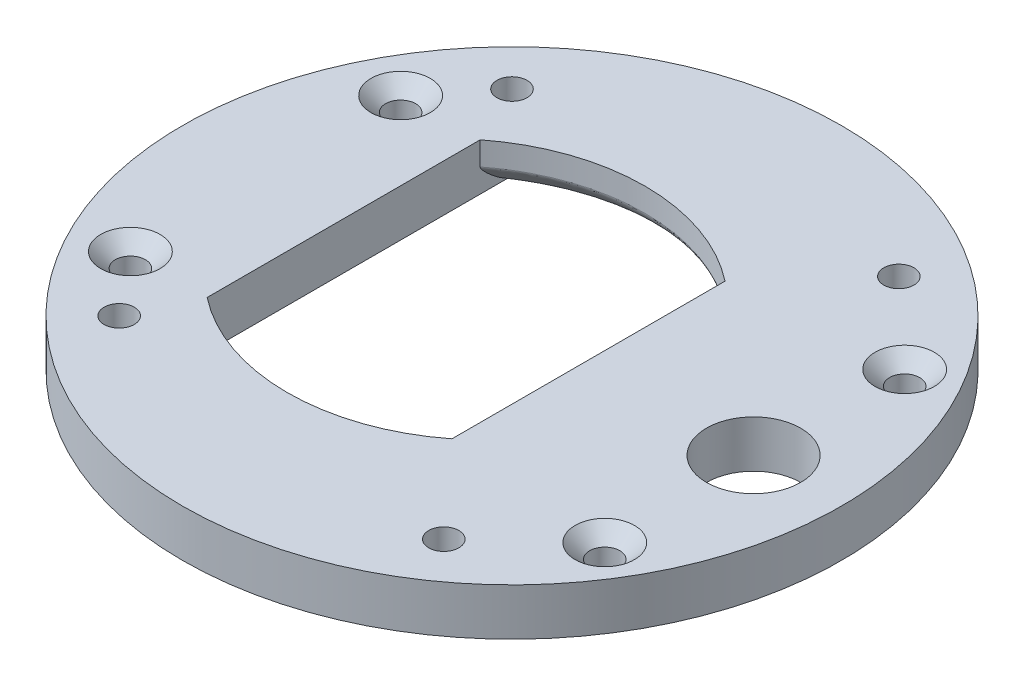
ISO-10303-21;
HEADER;
FILE_DESCRIPTION(('STEP AP214'),'2;1');
FILE_NAME('part.step','',(''),(''),'','','');
FILE_SCHEMA(('AUTOMOTIVE_DESIGN { 1 0 10303 214 1 1 1 1 }'));
ENDSEC;
DATA;
#1=APPLICATION_CONTEXT('core data for automotive mechanical design processes');
#2=APPLICATION_PROTOCOL_DEFINITION('international standard','automotive_design',2000,#1);
#3=PRODUCT_CONTEXT('',#1,'mechanical');
#4=PRODUCT('Part','Part','',(#3));
#5=PRODUCT_RELATED_PRODUCT_CATEGORY('part','',(#4));
#6=PRODUCT_DEFINITION_FORMATION('','',#4);
#7=PRODUCT_DEFINITION_CONTEXT('part definition',#1,'design');
#8=PRODUCT_DEFINITION('design','',#6,#7);
#9=PRODUCT_DEFINITION_SHAPE('','',#8);
#10=(LENGTH_UNIT() NAMED_UNIT(*) SI_UNIT(.MILLI.,.METRE.));
#11=(NAMED_UNIT(*) PLANE_ANGLE_UNIT() SI_UNIT($,.RADIAN.));
#12=(NAMED_UNIT(*) SI_UNIT($,.STERADIAN.) SOLID_ANGLE_UNIT());
#13=UNCERTAINTY_MEASURE_WITH_UNIT(LENGTH_MEASURE(1.E-05),#10,'distance_accuracy_value','');
#14=(GEOMETRIC_REPRESENTATION_CONTEXT(3) GLOBAL_UNCERTAINTY_ASSIGNED_CONTEXT((#13)) GLOBAL_UNIT_ASSIGNED_CONTEXT((#10,
#11,#12)) REPRESENTATION_CONTEXT('',''));
#15=CARTESIAN_POINT('',(0.,0.,0.));
#16=DIRECTION('',(0.,0.,1.));
#17=DIRECTION('',(1.,0.,0.));
#18=AXIS2_PLACEMENT_3D('',#15,#16,#17);
#19=CARTESIAN_POINT('',(-56.4,35.,14.35));
#20=DIRECTION('',(0.,1.,0.));
#21=DIRECTION('',(0.,0.,1.));
#22=AXIS2_PLACEMENT_3D('',#19,#20,#21);
#23=CYLINDRICAL_SURFACE('',#22,1.6);
#24=CARTESIAN_POINT('',(-56.4,30.,14.35));
#25=DIRECTION('',(0.,1.,0.));
#26=DIRECTION('',(0.,0.,1.));
#27=AXIS2_PLACEMENT_3D('',#24,#25,#26);
#28=CIRCLE('',#27,1.6);
#29=CARTESIAN_POINT('',(-56.4,30.,15.95));
#30=VERTEX_POINT('',#29);
#31=EDGE_CURVE('E493',#30,#30,#28,.T.);
#32=ORIENTED_EDGE('',*,*,#31,.F.);
#33=EDGE_LOOP('',(#32));
#34=FACE_BOUND('',#33,.T.);
#35=CARTESIAN_POINT('',(-56.4,33.45,14.35));
#36=DIRECTION('',(0.,1.,0.));
#37=DIRECTION('',(0.,0.,1.));
#38=AXIS2_PLACEMENT_3D('',#35,#36,#37);
#39=CIRCLE('',#38,1.6);
#40=CARTESIAN_POINT('',(-56.4,33.45,15.95));
#41=VERTEX_POINT('',#40);
#42=EDGE_CURVE('E497',#41,#41,#39,.T.);
#43=ORIENTED_EDGE('',*,*,#42,.T.);
#44=EDGE_LOOP('',(#43));
#45=FACE_BOUND('',#44,.T.);
#46=ADVANCED_FACE('F50',(#34,#45),#23,.F.);
#47=CARTESIAN_POINT('',(-56.4,35.,14.35));
#48=DIRECTION('',(0.,1.,0.));
#49=DIRECTION('',(0.,0.,1.));
#50=AXIS2_PLACEMENT_3D('',#47,#48,#49);
#51=CONICAL_SURFACE('',#50,3.15,0.785398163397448);
#52=ORIENTED_EDGE('',*,*,#42,.F.);
#53=EDGE_LOOP('',(#52));
#54=FACE_BOUND('',#53,.T.);
#55=CARTESIAN_POINT('',(-56.4,35.,14.35));
#56=DIRECTION('',(0.,1.,0.));
#57=DIRECTION('',(0.,0.,1.));
#58=AXIS2_PLACEMENT_3D('',#55,#56,#57);
#59=CIRCLE('',#58,3.15);
#60=CARTESIAN_POINT('',(-56.4,35.,17.5));
#61=VERTEX_POINT('',#60);
#62=EDGE_CURVE('E501',#61,#61,#59,.T.);
#63=ORIENTED_EDGE('',*,*,#62,.T.);
#64=EDGE_LOOP('',(#63));
#65=FACE_BOUND('',#64,.T.);
#66=ADVANCED_FACE('F426',(#54,#65),#51,.F.);
#67=CARTESIAN_POINT('',(-4.445,35.,15.925));
#68=DIRECTION('',(0.,1.,0.));
#69=DIRECTION('',(0.,0.,1.));
#70=AXIS2_PLACEMENT_3D('',#67,#68,#69);
#71=CYLINDRICAL_SURFACE('',#70,1.6);
#72=CARTESIAN_POINT('',(-4.445,30.,15.925));
#73=DIRECTION('',(0.,1.,0.));
#74=DIRECTION('',(0.,0.,1.));
#75=AXIS2_PLACEMENT_3D('',#72,#73,#74);
#76=CIRCLE('',#75,1.6);
#77=CARTESIAN_POINT('',(-4.445,30.,17.525));
#78=VERTEX_POINT('',#77);
#79=EDGE_CURVE('E481',#78,#78,#76,.T.);
#80=ORIENTED_EDGE('',*,*,#79,.F.);
#81=EDGE_LOOP('',(#80));
#82=FACE_BOUND('',#81,.T.);
#83=CARTESIAN_POINT('',(-4.445,33.45,15.925));
#84=DIRECTION('',(0.,1.,0.));
#85=DIRECTION('',(0.,0.,1.));
#86=AXIS2_PLACEMENT_3D('',#83,#84,#85);
#87=CIRCLE('',#86,1.6);
#88=CARTESIAN_POINT('',(-4.445,33.45,17.525));
#89=VERTEX_POINT('',#88);
#90=EDGE_CURVE('E485',#89,#89,#87,.T.);
#91=ORIENTED_EDGE('',*,*,#90,.T.);
#92=EDGE_LOOP('',(#91));
#93=FACE_BOUND('',#92,.T.);
#94=ADVANCED_FACE('F432',(#82,#93),#71,.F.);
#95=CARTESIAN_POINT('',(-4.445,35.,15.925));
#96=DIRECTION('',(0.,1.,0.));
#97=DIRECTION('',(0.,0.,1.));
#98=AXIS2_PLACEMENT_3D('',#95,#96,#97);
#99=CONICAL_SURFACE('',#98,3.15,0.785398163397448);
#100=ORIENTED_EDGE('',*,*,#90,.F.);
#101=EDGE_LOOP('',(#100));
#102=FACE_BOUND('',#101,.T.);
#103=CARTESIAN_POINT('',(-4.445,35.,15.925));
#104=DIRECTION('',(0.,1.,0.));
#105=DIRECTION('',(0.,0.,1.));
#106=AXIS2_PLACEMENT_3D('',#103,#104,#105);
#107=CIRCLE('',#106,3.15);
#108=CARTESIAN_POINT('',(-4.445,35.,19.075));
#109=VERTEX_POINT('',#108);
#110=EDGE_CURVE('E489',#109,#109,#107,.T.);
#111=ORIENTED_EDGE('',*,*,#110,.T.);
#112=EDGE_LOOP('',(#111));
#113=FACE_BOUND('',#112,.T.);
#114=ADVANCED_FACE('F438',(#102,#113),#99,.F.);
#115=CARTESIAN_POINT('',(-56.4,35.,-14.35));
#116=DIRECTION('',(0.,1.,0.));
#117=DIRECTION('',(0.,0.,1.));
#118=AXIS2_PLACEMENT_3D('',#115,#116,#117);
#119=CYLINDRICAL_SURFACE('',#118,1.6);
#120=CARTESIAN_POINT('',(-56.4,30.,-14.35));
#121=DIRECTION('',(0.,1.,0.));
#122=DIRECTION('',(0.,0.,1.));
#123=AXIS2_PLACEMENT_3D('',#120,#121,#122);
#124=CIRCLE('',#123,1.6);
#125=CARTESIAN_POINT('',(-56.4,30.,-12.75));
#126=VERTEX_POINT('',#125);
#127=EDGE_CURVE('E466',#126,#126,#124,.T.);
#128=ORIENTED_EDGE('',*,*,#127,.F.);
#129=EDGE_LOOP('',(#128));
#130=FACE_BOUND('',#129,.T.);
#131=CARTESIAN_POINT('',(-56.4,33.45,-14.35));
#132=DIRECTION('',(0.,1.,0.));
#133=DIRECTION('',(0.,0.,1.));
#134=AXIS2_PLACEMENT_3D('',#131,#132,#133);
#135=CIRCLE('',#134,1.6);
#136=CARTESIAN_POINT('',(-56.4,33.45,-12.75));
#137=VERTEX_POINT('',#136);
#138=EDGE_CURVE('E471',#137,#137,#135,.T.);
#139=ORIENTED_EDGE('',*,*,#138,.T.);
#140=EDGE_LOOP('',(#139));
#141=FACE_BOUND('',#140,.T.);
#142=ADVANCED_FACE('F441',(#130,#141),#119,.F.);
#143=CARTESIAN_POINT('',(-56.4,35.,-14.35));
#144=DIRECTION('',(0.,1.,0.));
#145=DIRECTION('',(0.,0.,1.));
#146=AXIS2_PLACEMENT_3D('',#143,#144,#145);
#147=CONICAL_SURFACE('',#146,3.15,0.785398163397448);
#148=ORIENTED_EDGE('',*,*,#138,.F.);
#149=EDGE_LOOP('',(#148));
#150=FACE_BOUND('',#149,.T.);
#151=CARTESIAN_POINT('',(-56.4,35.,-14.35));
#152=DIRECTION('',(0.,1.,0.));
#153=DIRECTION('',(0.,0.,1.));
#154=AXIS2_PLACEMENT_3D('',#151,#152,#153);
#155=CIRCLE('',#154,3.15);
#156=CARTESIAN_POINT('',(-56.4,35.,-11.2));
#157=VERTEX_POINT('',#156);
#158=EDGE_CURVE('E477',#157,#157,#155,.T.);
#159=ORIENTED_EDGE('',*,*,#158,.T.);
#160=EDGE_LOOP('',(#159));
#161=FACE_BOUND('',#160,.T.);
#162=ADVANCED_FACE('F446',(#150,#161),#147,.F.);
#163=CARTESIAN_POINT('',(-4.445,35.,-15.925));
#164=DIRECTION('',(0.,1.,0.));
#165=DIRECTION('',(0.,0.,1.));
#166=AXIS2_PLACEMENT_3D('',#163,#164,#165);
#167=CYLINDRICAL_SURFACE('',#166,1.6);
#168=CARTESIAN_POINT('',(-4.445,30.,-15.925));
#169=DIRECTION('',(0.,1.,0.));
#170=DIRECTION('',(0.,0.,1.));
#171=AXIS2_PLACEMENT_3D('',#168,#169,#170);
#172=CIRCLE('',#171,1.6);
#173=CARTESIAN_POINT('',(-4.445,30.,-14.325));
#174=VERTEX_POINT('',#173);
#175=EDGE_CURVE('E287',#174,#174,#172,.T.);
#176=ORIENTED_EDGE('',*,*,#175,.F.);
#177=EDGE_LOOP('',(#176));
#178=FACE_BOUND('',#177,.T.);
#179=CARTESIAN_POINT('',(-4.445,33.45,-15.925));
#180=DIRECTION('',(0.,1.,0.));
#181=DIRECTION('',(0.,0.,1.));
#182=AXIS2_PLACEMENT_3D('',#179,#180,#181);
#183=CIRCLE('',#182,1.6);
#184=CARTESIAN_POINT('',(-4.445,33.45,-14.325));
#185=VERTEX_POINT('',#184);
#186=EDGE_CURVE('E293',#185,#185,#183,.T.);
#187=ORIENTED_EDGE('',*,*,#186,.T.);
#188=EDGE_LOOP('',(#187));
#189=FACE_BOUND('',#188,.T.);
#190=ADVANCED_FACE('F403',(#178,#189),#167,.F.);
#191=CARTESIAN_POINT('',(-4.445,35.,-15.925));
#192=DIRECTION('',(0.,1.,0.));
#193=DIRECTION('',(0.,0.,1.));
#194=AXIS2_PLACEMENT_3D('',#191,#192,#193);
#195=CONICAL_SURFACE('',#194,3.15,0.785398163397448);
#196=ORIENTED_EDGE('',*,*,#186,.F.);
#197=EDGE_LOOP('',(#196));
#198=FACE_BOUND('',#197,.T.);
#199=CARTESIAN_POINT('',(-4.445,35.,-15.925));
#200=DIRECTION('',(0.,1.,0.));
#201=DIRECTION('',(0.,0.,1.));
#202=AXIS2_PLACEMENT_3D('',#199,#200,#201);
#203=CIRCLE('',#202,3.15);
#204=CARTESIAN_POINT('',(-4.445,35.,-12.775));
#205=VERTEX_POINT('',#204);
#206=EDGE_CURVE('E463',#205,#205,#203,.T.);
#207=ORIENTED_EDGE('',*,*,#206,.T.);
#208=EDGE_LOOP('',(#207));
#209=FACE_BOUND('',#208,.T.);
#210=ADVANCED_FACE('F187',(#198,#209),#195,.F.);
#211=CARTESIAN_POINT('',(-30.2225,35.,0.));
#212=DIRECTION('',(0.,1.,0.));
#213=DIRECTION('',(0.,0.,1.));
#214=AXIS2_PLACEMENT_3D('',#211,#212,#213);
#215=PLANE('',#214);
#216=ORIENTED_EDGE('',*,*,#62,.F.);
#217=EDGE_LOOP('',(#216));
#218=FACE_BOUND('',#217,.T.);
#219=ORIENTED_EDGE('',*,*,#110,.F.);
#220=EDGE_LOOP('',(#219));
#221=FACE_BOUND('',#220,.T.);
#222=ORIENTED_EDGE('',*,*,#158,.F.);
#223=EDGE_LOOP('',(#222));
#224=FACE_BOUND('',#223,.T.);
#225=ORIENTED_EDGE('',*,*,#206,.F.);
#226=EDGE_LOOP('',(#225));
#227=FACE_BOUND('',#226,.T.);
#228=CARTESIAN_POINT('',(-51.0821500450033,35.,-20.859650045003));
#229=DIRECTION('',(0.,1.,0.));
#230=DIRECTION('',(0.,0.,1.));
#231=AXIS2_PLACEMENT_3D('',#228,#229,#230);
#232=CIRCLE('',#231,1.6);
#233=CARTESIAN_POINT('',(-51.0821500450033,35.,-19.259650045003));
#234=VERTEX_POINT('',#233);
#235=EDGE_CURVE('E316',#234,#234,#232,.T.);
#236=ORIENTED_EDGE('',*,*,#235,.F.);
#237=EDGE_LOOP('',(#236));
#238=FACE_BOUND('',#237,.T.);
#239=CARTESIAN_POINT('',(-13.3019951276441,35.,-24.1649853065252));
#240=DIRECTION('',(0.,1.,0.));
#241=DIRECTION('',(0.,0.,1.));
#242=AXIS2_PLACEMENT_3D('',#239,#240,#241);
#243=CIRCLE('',#242,1.6);
#244=CARTESIAN_POINT('',(-13.3019951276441,35.,-22.5649853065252));
#245=VERTEX_POINT('',#244);
#246=EDGE_CURVE('E322',#245,#245,#243,.T.);
#247=ORIENTED_EDGE('',*,*,#246,.F.);
#248=EDGE_LOOP('',(#247));
#249=FACE_BOUND('',#248,.T.);
#250=CARTESIAN_POINT('',(-13.3019951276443,35.,24.1649853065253));
#251=DIRECTION('',(0.,1.,0.));
#252=DIRECTION('',(0.,0.,1.));
#253=AXIS2_PLACEMENT_3D('',#250,#251,#252);
#254=CIRCLE('',#253,1.6);
#255=CARTESIAN_POINT('',(-13.3019951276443,35.,25.7649853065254));
#256=VERTEX_POINT('',#255);
#257=EDGE_CURVE('E317',#256,#256,#254,.T.);
#258=ORIENTED_EDGE('',*,*,#257,.F.);
#259=EDGE_LOOP('',(#258));
#260=FACE_BOUND('',#259,.T.);
#261=CARTESIAN_POINT('',(-51.082150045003,35.,20.8596500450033));
#262=DIRECTION('',(0.,1.,0.));
#263=DIRECTION('',(0.,0.,1.));
#264=AXIS2_PLACEMENT_3D('',#261,#262,#263);
#265=CIRCLE('',#264,1.6);
#266=CARTESIAN_POINT('',(-51.082150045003,35.,22.4596500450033));
#267=VERTEX_POINT('',#266);
#268=EDGE_CURVE('E321',#267,#267,#265,.T.);
#269=ORIENTED_EDGE('',*,*,#268,.F.);
#270=EDGE_LOOP('',(#269));
#271=FACE_BOUND('',#270,.T.);
#272=CARTESIAN_POINT('',(-35.1,35.,2.05000000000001));
#273=DIRECTION('',(0.,1.,0.));
#274=DIRECTION('',(0.,0.,-1.));
#275=AXIS2_PLACEMENT_3D('',#272,#273,#274);
#276=CIRCLE('',#275,21.0452488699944);
#277=CARTESIAN_POINT('',(-22.1,35.,-14.5));
#278=VERTEX_POINT('',#277);
#279=CARTESIAN_POINT('',(-48.1,35.,-14.5));
#280=VERTEX_POINT('',#279);
#281=EDGE_CURVE('E134',#278,#280,#276,.T.);
#282=ORIENTED_EDGE('',*,*,#281,.F.);
#283=DIRECTION('',(0.,0.,-1.));
#284=VECTOR('',#283,1.);
#285=CARTESIAN_POINT('',(-22.1,35.,-14.5));
#286=LINE('',#285,#284);
#287=CARTESIAN_POINT('',(-22.1,35.,14.5));
#288=VERTEX_POINT('',#287);
#289=EDGE_CURVE('E139',#288,#278,#286,.T.);
#290=ORIENTED_EDGE('',*,*,#289,.F.);
#291=CARTESIAN_POINT('',(-35.1,35.,-2.05000000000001));
#292=DIRECTION('',(0.,1.,0.));
#293=DIRECTION('',(0.,0.,1.));
#294=AXIS2_PLACEMENT_3D('',#291,#292,#293);
#295=CIRCLE('',#294,21.0452488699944);
#296=CARTESIAN_POINT('',(-48.1,35.,14.5));
#297=VERTEX_POINT('',#296);
#298=EDGE_CURVE('E117',#297,#288,#295,.T.);
#299=ORIENTED_EDGE('',*,*,#298,.F.);
#300=DIRECTION('',(0.,0.,1.));
#301=VECTOR('',#300,1.);
#302=CARTESIAN_POINT('',(-48.1,35.,-14.5));
#303=LINE('',#302,#301);
#304=EDGE_CURVE('E128',#280,#297,#303,.T.);
#305=ORIENTED_EDGE('',*,*,#304,.F.);
#306=EDGE_LOOP('',(#282,#290,#299,#305));
#307=FACE_BOUND('',#306,.T.);
#308=CARTESIAN_POINT('',(-30.2225,35.,0.));
#309=DIRECTION('',(0.,1.,0.));
#310=DIRECTION('',(0.,0.,1.));
#311=AXIS2_PLACEMENT_3D('',#308,#309,#310);
#312=CIRCLE('',#311,35.);
#313=CARTESIAN_POINT('',(-30.2225,35.,35.));
#314=VERTEX_POINT('',#313);
#315=EDGE_CURVE('E337',#314,#314,#312,.T.);
#316=ORIENTED_EDGE('',*,*,#315,.T.);
#317=EDGE_LOOP('',(#316));
#318=FACE_BOUND('',#317,.T.);
#319=CARTESIAN_POINT('',(-4.5675,35.,0.));
#320=DIRECTION('',(0.,1.,0.));
#321=DIRECTION('',(0.,0.,1.));
#322=AXIS2_PLACEMENT_3D('',#319,#320,#321);
#323=CIRCLE('',#322,5.);
#324=CARTESIAN_POINT('',(-4.5675,35.,5.));
#325=VERTEX_POINT('',#324);
#326=EDGE_CURVE('E155',#325,#325,#323,.T.);
#327=ORIENTED_EDGE('',*,*,#326,.F.);
#328=EDGE_LOOP('',(#327));
#329=FACE_BOUND('',#328,.T.);
#330=ADVANCED_FACE('F136',(#218,#221,#224,#227,#238,#249,#260,#271,#307,#318,#329),#215,.T.);
#331=CARTESIAN_POINT('',(-30.2225,35.,0.));
#332=DIRECTION('',(0.,-1.,0.));
#333=DIRECTION('',(0.,0.,-1.));
#334=AXIS2_PLACEMENT_3D('',#331,#332,#333);
#335=CYLINDRICAL_SURFACE('',#334,35.);
#336=ORIENTED_EDGE('',*,*,#315,.F.);
#337=EDGE_LOOP('',(#336));
#338=FACE_BOUND('',#337,.T.);
#339=CARTESIAN_POINT('',(-30.2225,30.,0.));
#340=DIRECTION('',(0.,-1.,0.));
#341=DIRECTION('',(0.,0.,-1.));
#342=AXIS2_PLACEMENT_3D('',#339,#340,#341);
#343=CIRCLE('',#342,35.);
#344=CARTESIAN_POINT('',(-30.2225,30.,-35.));
#345=VERTEX_POINT('',#344);
#346=EDGE_CURVE('E312',#345,#345,#343,.T.);
#347=ORIENTED_EDGE('',*,*,#346,.F.);
#348=EDGE_LOOP('',(#347));
#349=FACE_BOUND('',#348,.T.);
#350=ADVANCED_FACE('F183',(#338,#349),#335,.T.);
#351=CARTESIAN_POINT('',(-4.5675,35.,0.));
#352=DIRECTION('',(0.,-1.,0.));
#353=DIRECTION('',(0.,0.,-1.));
#354=AXIS2_PLACEMENT_3D('',#351,#352,#353);
#355=CYLINDRICAL_SURFACE('',#354,5.);
#356=ORIENTED_EDGE('',*,*,#326,.T.);
#357=EDGE_LOOP('',(#356));
#358=FACE_BOUND('',#357,.T.);
#359=CARTESIAN_POINT('',(-4.5675,30.,0.));
#360=DIRECTION('',(0.,-1.,0.));
#361=DIRECTION('',(0.,0.,-1.));
#362=AXIS2_PLACEMENT_3D('',#359,#360,#361);
#363=CIRCLE('',#362,5.);
#364=CARTESIAN_POINT('',(-4.5675,30.,-5.));
#365=VERTEX_POINT('',#364);
#366=EDGE_CURVE('E300',#365,#365,#363,.T.);
#367=ORIENTED_EDGE('',*,*,#366,.T.);
#368=EDGE_LOOP('',(#367));
#369=FACE_BOUND('',#368,.T.);
#370=ADVANCED_FACE('F178',(#358,#369),#355,.F.);
#371=CARTESIAN_POINT('',(-35.1,31.,2.05000000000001));
#372=DIRECTION('',(0.,1.,0.));
#373=DIRECTION('',(0.,0.,1.));
#374=AXIS2_PLACEMENT_3D('',#371,#372,#373);
#375=CYLINDRICAL_SURFACE('',#374,21.0452488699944);
#376=DIRECTION('',(0.,1.,0.));
#377=VECTOR('',#376,1.);
#378=CARTESIAN_POINT('',(-48.1,31.,-14.5));
#379=LINE('',#378,#377);
#380=CARTESIAN_POINT('',(-48.0998956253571,32.5,-14.4998670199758));
#381=VERTEX_POINT('',#380);
#382=EDGE_CURVE('E125',#381,#280,#379,.T.);
#383=ORIENTED_EDGE('',*,*,#382,.F.);
#384=CARTESIAN_POINT('',(-21.0276620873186,32.5,-13.5983802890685));
#385=CARTESIAN_POINT('',(-22.938119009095,32.5,-15.3164236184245));
#386=CARTESIAN_POINT('',(-25.1654928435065,32.5,-16.6798634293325));
#387=CARTESIAN_POINT('',(-29.9627824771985,32.5,-18.5196672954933));
#388=CARTESIAN_POINT('',(-32.5310086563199,32.5,-18.9952488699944));
#389=CARTESIAN_POINT('',(-37.6689913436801,32.5,-18.9952488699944));
#390=CARTESIAN_POINT('',(-40.2372175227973,32.5,-18.519667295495));
#391=CARTESIAN_POINT('',(-45.034507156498,32.5,-16.6798634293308));
#392=CARTESIAN_POINT('',(-47.2618809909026,32.5,-15.3164236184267));
#393=CARTESIAN_POINT('',(-49.1723379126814,32.5,-13.5983802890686));
#394=(BOUNDED_CURVE() B_SPLINE_CURVE(3,(#384,#385,#386,#387,#388,#389,#390,#391,#392,#393),
.UNSPECIFIED.,.F.,.F.) B_SPLINE_CURVE_WITH_KNOTS((4,2,2,2,4),(5.55076593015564,5.91697561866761,
6.28318530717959,6.64939499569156,7.01560468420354),
.UNSPECIFIED.) CURVE() GEOMETRIC_REPRESENTATION_ITEM() RATIONAL_B_SPLINE_CURVE((1.,1.,1.,1.,1.,
1.,1.,1.,1.,1.)) REPRESENTATION_ITEM(''));
#395=CARTESIAN_POINT('',(-22.1,32.5,-14.4997850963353));
#396=VERTEX_POINT('',#395);
#397=EDGE_CURVE('E160',#381,#396,#394,.F.);
#398=ORIENTED_EDGE('',*,*,#397,.T.);
#399=DIRECTION('',(0.,1.,0.));
#400=VECTOR('',#399,1.);
#401=CARTESIAN_POINT('',(-22.1,31.,-14.5));
#402=LINE('',#401,#400);
#403=EDGE_CURVE('E151',#396,#278,#402,.T.);
#404=ORIENTED_EDGE('',*,*,#403,.T.);
#405=ORIENTED_EDGE('',*,*,#281,.T.);
#406=EDGE_LOOP('',(#383,#398,#404,#405));
#407=FACE_BOUND('',#406,.T.);
#408=ADVANCED_FACE('F167',(#407),#375,.F.);
#409=CARTESIAN_POINT('',(-22.1,31.,-14.5));
#410=DIRECTION('',(1.,0.,0.));
#411=DIRECTION('',(0.,0.,-1.));
#412=AXIS2_PLACEMENT_3D('',#409,#410,#411);
#413=PLANE('',#412);
#414=ORIENTED_EDGE('',*,*,#289,.T.);
#415=ORIENTED_EDGE('',*,*,#403,.F.);
#416=CARTESIAN_POINT('',(-22.1,30.,-17.5798744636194));
#417=CARTESIAN_POINT('',(-22.0999994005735,30.0000035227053,-17.5748494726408));
#418=CARTESIAN_POINT('',(-22.0999912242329,30.0001684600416,-17.5698278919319));
#419=CARTESIAN_POINT('',(-22.0999639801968,30.0007961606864,-17.5593566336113));
#420=CARTESIAN_POINT('',(-22.0999440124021,30.0012839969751,-17.5539084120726));
#421=CARTESIAN_POINT('',(-22.0998976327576,30.0025668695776,-17.5425794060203));
#422=CARTESIAN_POINT('',(-22.0998708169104,30.0033845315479,-17.5367013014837));
#423=CARTESIAN_POINT('',(-22.0998140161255,30.005340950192,-17.5245069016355));
#424=CARTESIAN_POINT('',(-22.0997839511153,30.0065004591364,-17.5181939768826));
#425=CARTESIAN_POINT('',(-22.0997238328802,30.0091521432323,-17.5051260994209));
#426=CARTESIAN_POINT('',(-22.0996939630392,30.0106631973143,-17.498375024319));
#427=CARTESIAN_POINT('',(-22.099636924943,30.0140291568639,-17.4844279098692));
#428=CARTESIAN_POINT('',(-22.0996101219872,30.0159012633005,-17.4772360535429));
#429=CARTESIAN_POINT('',(-22.0995614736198,30.0199992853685,-17.4624055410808));
#430=CARTESIAN_POINT('',(-22.0995401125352,30.0222408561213,-17.4547712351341));
#431=CARTESIAN_POINT('',(-22.0995040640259,30.0270871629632,-17.4390553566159));
#432=CARTESIAN_POINT('',(-22.0994899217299,30.0297061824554,-17.430978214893));
#433=CARTESIAN_POINT('',(-22.09945841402,30.0383793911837,-17.4053003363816));
#434=CARTESIAN_POINT('',(-22.0994573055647,30.044806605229,-17.3878254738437));
#435=CARTESIAN_POINT('',(-22.0994869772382,30.0591423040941,-17.3510913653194));
#436=CARTESIAN_POINT('',(-22.0995215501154,30.0671360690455,-17.3318659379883));
#437=CARTESIAN_POINT('',(-22.0996140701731,30.0846405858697,-17.2916673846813));
#438=CARTESIAN_POINT('',(-22.0996741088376,30.0942222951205,-17.2707253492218));
#439=CARTESIAN_POINT('',(-22.0997992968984,30.1149119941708,-17.2271519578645));
#440=CARTESIAN_POINT('',(-22.099864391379,30.1260785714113,-17.2045486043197));
#441=CARTESIAN_POINT('',(-22.0999640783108,30.1499206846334,-17.1577286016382));
#442=CARTESIAN_POINT('',(-22.0999956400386,30.1626440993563,-17.1335364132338));
#443=CARTESIAN_POINT('',(-22.1000024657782,30.1829608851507,-17.0958782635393));
#444=CARTESIAN_POINT('',(-22.0999962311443,30.1903815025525,-17.0823184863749));
#445=CARTESIAN_POINT('',(-22.0999742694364,30.2140509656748,-17.0396304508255));
#446=CARTESIAN_POINT('',(-22.0999559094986,30.23057387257,-17.0106537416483));
#447=CARTESIAN_POINT('',(-22.0999305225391,30.2658510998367,-16.9501905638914));
#448=CARTESIAN_POINT('',(-22.0999247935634,30.2846646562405,-16.9187387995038));
#449=CARTESIAN_POINT('',(-22.0999322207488,30.3245888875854,-16.8533683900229));
#450=CARTESIAN_POINT('',(-22.0999471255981,30.3457537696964,-16.8194829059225));
#451=CARTESIAN_POINT('',(-22.0999818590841,30.390406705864,-16.7493264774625));
#452=CARTESIAN_POINT('',(-22.100001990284,30.4139433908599,-16.7130865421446));
#453=CARTESIAN_POINT('',(-22.0999984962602,30.4557546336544,-16.6497915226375));
#454=CARTESIAN_POINT('',(-22.0999843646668,30.4739090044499,-16.6226568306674));
#455=CARTESIAN_POINT('',(-22.0999566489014,30.5120531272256,-16.5663194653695));
#456=CARTESIAN_POINT('',(-22.0999432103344,30.5320689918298,-16.537134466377));
#457=CARTESIAN_POINT('',(-22.0999334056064,30.5740057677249,-16.4767147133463));
#458=CARTESIAN_POINT('',(-22.0999384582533,30.5959531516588,-16.4454983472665));
#459=CARTESIAN_POINT('',(-22.0999586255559,30.6417937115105,-16.3810623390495));
#460=CARTESIAN_POINT('',(-22.0999744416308,30.6657127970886,-16.3478611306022));
#461=CARTESIAN_POINT('',(-22.0999972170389,30.702466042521,-16.2974358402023));
#462=CARTESIAN_POINT('',(-22.1000048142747,30.7151677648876,-16.2801150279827));
#463=CARTESIAN_POINT('',(-22.0999971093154,30.7355676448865,-16.2524468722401));
#464=CARTESIAN_POINT('',(-22.0999897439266,30.7432372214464,-16.2420784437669));
#465=CARTESIAN_POINT('',(-22.0999543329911,30.7688645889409,-16.2075460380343));
#466=CARTESIAN_POINT('',(-22.0999118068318,30.7868944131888,-16.183435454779));
#467=CARTESIAN_POINT('',(-22.0998490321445,30.8266633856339,-16.1306928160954));
#468=CARTESIAN_POINT('',(-22.0998347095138,30.8484432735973,-16.1020914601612));
#469=CARTESIAN_POINT('',(-22.0998490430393,30.8958625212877,-16.0404187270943));
#470=CARTESIAN_POINT('',(-22.0998851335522,30.9215490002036,-16.0073835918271));
#471=CARTESIAN_POINT('',(-22.0999487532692,30.9768554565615,-15.9369782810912));
#472=CARTESIAN_POINT('',(-22.0999743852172,31.0065241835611,-15.8996464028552));
#473=CARTESIAN_POINT('',(-22.1000255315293,31.0661872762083,-15.8254432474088));
#474=CARTESIAN_POINT('',(-22.100051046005,31.096180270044,-15.7885708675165));
#475=CARTESIAN_POINT('',(-22.1001143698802,31.1529471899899,-15.7196054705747));
#476=CARTESIAN_POINT('',(-22.1001503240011,31.1796727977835,-15.6874726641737));
#477=CARTESIAN_POINT('',(-22.1001646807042,31.2296904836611,-15.6279220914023));
#478=CARTESIAN_POINT('',(-22.1001503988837,31.2529425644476,-15.6004707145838));
#479=CARTESIAN_POINT('',(-22.1000879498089,31.2959210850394,-15.5501690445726));
#480=CARTESIAN_POINT('',(-22.100045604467,31.3156128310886,-15.5272891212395));
#481=CARTESIAN_POINT('',(-22.100010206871,31.3438911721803,-15.4947118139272));
#482=CARTESIAN_POINT('',(-22.1000028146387,31.3523991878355,-15.4849462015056));
#483=CARTESIAN_POINT('',(-22.0999953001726,31.3751630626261,-15.4589173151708));
#484=CARTESIAN_POINT('',(-22.100003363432,31.3894519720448,-15.4426829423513));
#485=CARTESIAN_POINT('',(-22.1000281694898,31.4310358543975,-15.395719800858));
#486=CARTESIAN_POINT('',(-22.100046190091,31.4584567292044,-15.3651023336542));
#487=CARTESIAN_POINT('',(-22.100068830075,31.5117054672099,-15.3063537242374));
#488=CARTESIAN_POINT('',(-22.1000743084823,31.5375085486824,-15.2782001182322));
#489=CARTESIAN_POINT('',(-22.10006322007,31.58746192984,-15.2243387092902));
#490=CARTESIAN_POINT('',(-22.100048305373,31.6115879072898,-15.1986083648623));
#491=CARTESIAN_POINT('',(-22.1000172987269,31.6581684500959,-15.1495323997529));
#492=CARTESIAN_POINT('',(-22.1000014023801,31.6805986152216,-15.1261636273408));
#493=CARTESIAN_POINT('',(-22.0999981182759,31.7334738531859,-15.0717760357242));
#494=CARTESIAN_POINT('',(-22.1000223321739,31.7640379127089,-15.04087260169));
#495=CARTESIAN_POINT('',(-22.1000640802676,31.8233006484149,-14.9820879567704));
#496=CARTESIAN_POINT('',(-22.1000819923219,31.8519545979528,-14.9541617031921));
#497=CARTESIAN_POINT('',(-22.1000914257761,31.9073122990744,-14.9013090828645));
#498=CARTESIAN_POINT('',(-22.1000851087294,31.9339686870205,-14.8763331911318));
#499=CARTESIAN_POINT('',(-22.1000523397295,31.9852930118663,-14.829325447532));
#500=CARTESIAN_POINT('',(-22.1000278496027,32.0099104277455,-14.8072386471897));
#501=CARTESIAN_POINT('',(-22.1000060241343,32.0463005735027,-14.77543148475));
#502=CARTESIAN_POINT('',(-22.1000011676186,32.0578511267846,-14.7654569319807));
#503=CARTESIAN_POINT('',(-22.0999983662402,32.0857244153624,-14.7417153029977));
#504=CARTESIAN_POINT('',(-22.1000039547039,32.102111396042,-14.7280239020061));
#505=CARTESIAN_POINT('',(-22.1000155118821,32.1482921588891,-14.6902779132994));
#506=CARTESIAN_POINT('',(-22.1000182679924,32.1784128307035,-14.6666149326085));
#507=CARTESIAN_POINT('',(-22.1000112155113,32.219498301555,-14.6361850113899));
#508=CARTESIAN_POINT('',(-22.1000085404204,32.2298891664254,-14.6286413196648));
#509=CARTESIAN_POINT('',(-22.1000017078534,32.2501708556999,-14.614266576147));
#510=CARTESIAN_POINT('',(-22.0999976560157,32.2600512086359,-14.6074207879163));
#511=CARTESIAN_POINT('',(-22.1000031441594,32.2833886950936,-14.5916927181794));
#512=CARTESIAN_POINT('',(-22.1000177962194,32.2969154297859,-14.5829130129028));
#513=CARTESIAN_POINT('',(-22.1000616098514,32.3231445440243,-14.5667030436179));
#514=CARTESIAN_POINT('',(-22.1000893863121,32.3358151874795,-14.5592219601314));
#515=CARTESIAN_POINT('',(-22.1001249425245,32.3546335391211,-14.5487723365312));
#516=CARTESIAN_POINT('',(-22.1001354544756,32.360633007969,-14.5455364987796));
#517=CARTESIAN_POINT('',(-22.1001530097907,32.3724023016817,-14.5394047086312));
#518=CARTESIAN_POINT('',(-22.1001602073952,32.3781674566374,-14.5364998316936));
#519=CARTESIAN_POINT('',(-22.1001701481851,32.3894629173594,-14.5310311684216));
#520=CARTESIAN_POINT('',(-22.1001731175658,32.3949883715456,-14.5284573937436));
#521=CARTESIAN_POINT('',(-22.1001742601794,32.4058004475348,-14.5236518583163));
#522=CARTESIAN_POINT('',(-22.1001727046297,32.4110820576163,-14.5214088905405));
#523=CARTESIAN_POINT('',(-22.1001657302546,32.4204294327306,-14.5176565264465));
#524=CARTESIAN_POINT('',(-22.100161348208,32.4244769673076,-14.5161017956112));
#525=CARTESIAN_POINT('',(-22.1001500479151,32.4324148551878,-14.5132101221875));
#526=CARTESIAN_POINT('',(-22.100143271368,32.4363026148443,-14.5118660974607));
#527=CARTESIAN_POINT('',(-22.1001277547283,32.4439197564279,-14.5093955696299));
#528=CARTESIAN_POINT('',(-22.1001191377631,32.4476466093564,-14.5082613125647));
#529=CARTESIAN_POINT('',(-22.1001007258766,32.4549410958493,-14.5062098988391));
#530=CARTESIAN_POINT('',(-22.1000910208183,32.4585063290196,-14.5052842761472));
#531=CARTESIAN_POINT('',(-22.1000714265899,32.4654768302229,-14.5036495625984));
#532=CARTESIAN_POINT('',(-22.1000615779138,32.4688799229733,-14.5029312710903));
#533=CARTESIAN_POINT('',(-22.1000428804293,32.4755260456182,-14.5017103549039));
#534=CARTESIAN_POINT('',(-22.1000340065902,32.4787672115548,-14.5011978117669));
#535=CARTESIAN_POINT('',(-22.100022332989,32.4835769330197,-14.500581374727));
#536=CARTESIAN_POINT('',(-22.1000187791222,32.4851361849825,-14.5004037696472));
#537=CARTESIAN_POINT('',(-22.1000124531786,32.4882142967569,-14.5001007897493));
#538=CARTESIAN_POINT('',(-22.1000096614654,32.4897330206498,-14.4999740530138));
#539=CARTESIAN_POINT('',(-22.1000050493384,32.4927300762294,-14.4997725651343));
#540=CARTESIAN_POINT('',(-22.1000032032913,32.4942083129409,-14.4996964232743));
#541=CARTESIAN_POINT('',(-22.100000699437,32.497124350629,-14.4995959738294));
#542=CARTESIAN_POINT('',(-22.1000000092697,32.4985621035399,-14.4995702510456));
#543=CARTESIAN_POINT('',(-22.1,32.5,-14.4995701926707));
#544=B_SPLINE_CURVE_WITH_KNOTS('',3,(#416,#417,#418,#419,#420,#421,#422,#423,#424,#425,#426,
#427,#428,#429,#430,#431,#432,#433,#434,#435,#436,#437,#438,#439,#440,#441,#442,#443,#444,#445,
#446,#447,#448,#449,#450,#451,#452,#453,#454,#455,#456,#457,#458,#459,#460,#461,#462,#463,#464,
#465,#466,#467,#468,#469,#470,#471,#472,#473,#474,#475,#476,#477,#478,#479,#480,#481,#482,#483,
#484,#485,#486,#487,#488,#489,#490,#491,#492,#493,#494,#495,#496,#497,#498,#499,#500,#501,#502,
#503,#504,#505,#506,#507,#508,#509,#510,#511,#512,#513,#514,#515,#516,#517,#518,#519,#520,#521,
#522,#523,#524,#525,#526,#527,#528,#529,#530,#531,#532,#533,#534,#535,#536,#537,#538,#539,#540,
#541,#542,#543),.UNSPECIFIED.,.F.,.F.,(4,2,2,2,2,2,2,2,2,2,2,2,2,2,2,2,2,2,2,2,2,2,2,2,2,2,2,2,
2,2,2,2,2,2,2,2,2,2,2,2,2,2,2,2,2,2,2,2,2,2,2,2,2,2,2,2,2,2,2,2,2,2,2,4),(0.,0.0150675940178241,
0.0314690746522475,0.0492674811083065,0.0685178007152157,0.0892677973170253,0.111558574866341,
0.135424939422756,0.160895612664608,0.216731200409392,0.279180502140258,0.348258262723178,
0.423882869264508,0.505876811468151,0.552248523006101,0.652308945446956,0.76224954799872,
0.882099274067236,1.01173003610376,1.10967130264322,1.21583658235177,1.33031265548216,
1.45306961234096,1.5175061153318,1.55619638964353,1.64651471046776,1.75436298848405,
1.87989977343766,2.0229531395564,2.16554155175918,2.29092283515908,2.39884816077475,
2.48940828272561,2.52826411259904,2.59314479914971,2.71644635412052,2.83101191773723,
2.93682551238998,3.03399803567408,3.16438485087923,3.28441235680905,3.39399157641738,
3.49320186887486,3.53898432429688,3.6030442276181,3.71790245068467,3.75642131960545,
3.79247902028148,3.84084588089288,3.88497115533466,3.90541839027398,3.92478249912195,
3.94306582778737,3.96027627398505,3.97328168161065,3.98561965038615,3.99730359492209,
4.00835037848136,4.01878072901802,4.02861972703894,4.03332713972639,4.03789841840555,
4.04233818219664,4.04665143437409),.UNSPECIFIED.);
#545=CARTESIAN_POINT('',(-22.1,30.,-17.5798744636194));
#546=VERTEX_POINT('',#545);
#547=EDGE_CURVE('E64',#396,#546,#544,.F.);
#548=ORIENTED_EDGE('',*,*,#547,.T.);
#549=DIRECTION('',(0.,0.,1.));
#550=VECTOR('',#549,1.);
#551=CARTESIAN_POINT('',(-22.1,30.,14.5));
#552=LINE('',#551,#550);
#553=CARTESIAN_POINT('',(-22.1,30.,17.5798744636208));
#554=VERTEX_POINT('',#553);
#555=EDGE_CURVE('E279',#546,#554,#552,.T.);
#556=ORIENTED_EDGE('',*,*,#555,.T.);
#557=CARTESIAN_POINT('',(-22.1,32.5,14.4995701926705));
#558=CARTESIAN_POINT('',(-22.1000000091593,32.4985657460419,14.49957025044));
#559=CARTESIAN_POINT('',(-22.1000006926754,32.4971316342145,14.4995958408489));
#560=CARTESIAN_POINT('',(-22.1000031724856,32.4942230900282,14.4996957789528));
#561=CARTESIAN_POINT('',(-22.1000050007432,32.4927487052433,14.4997715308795));
#562=CARTESIAN_POINT('',(-22.1000095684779,32.4897595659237,14.4999719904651));
#563=CARTESIAN_POINT('',(-22.1000123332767,32.4882449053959,14.5000980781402));
#564=CARTESIAN_POINT('',(-22.1000185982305,32.485175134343,14.5003995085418));
#565=CARTESIAN_POINT('',(-22.1000221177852,32.4836201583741,14.5005762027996));
#566=CARTESIAN_POINT('',(-22.1000336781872,32.4788239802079,14.5011894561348));
#567=CARTESIAN_POINT('',(-22.1000424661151,32.4755920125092,14.5016993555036));
#568=CARTESIAN_POINT('',(-22.1000609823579,32.4689651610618,14.5029139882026));
#569=CARTESIAN_POINT('',(-22.1000707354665,32.4655721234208,14.5036285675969));
#570=CARTESIAN_POINT('',(-22.1000901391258,32.4586226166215,14.505254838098));
#571=CARTESIAN_POINT('',(-22.1000997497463,32.4550683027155,14.506175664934));
#572=CARTESIAN_POINT('',(-22.1001179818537,32.4477965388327,14.5082164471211));
#573=CARTESIAN_POINT('',(-22.1001265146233,32.4440814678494,14.5093448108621));
#574=CARTESIAN_POINT('',(-22.1001418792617,32.4364887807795,14.5118024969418));
#575=CARTESIAN_POINT('',(-22.1001485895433,32.4326136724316,14.5131395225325));
#576=CARTESIAN_POINT('',(-22.1001597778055,32.4247019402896,14.5160161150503));
#577=CARTESIAN_POINT('',(-22.1001641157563,32.4206678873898,14.5175627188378));
#578=CARTESIAN_POINT('',(-22.1001702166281,32.4124396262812,14.5208597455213));
#579=CARTESIAN_POINT('',(-22.1001718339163,32.4082479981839,14.5226165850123));
#580=CARTESIAN_POINT('',(-22.1001723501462,32.3997064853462,14.526335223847));
#581=CARTESIAN_POINT('',(-22.1001711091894,32.3953591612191,14.5283028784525));
#582=CARTESIAN_POINT('',(-22.1001632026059,32.3817712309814,14.5346591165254));
#583=CARTESIAN_POINT('',(-22.1001519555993,32.3726215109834,14.5392423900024));
#584=CARTESIAN_POINT('',(-22.1001220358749,32.3537097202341,14.549212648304));
#585=CARTESIAN_POINT('',(-22.1001027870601,32.3439664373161,14.5546348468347));
#586=CARTESIAN_POINT('',(-22.100063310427,32.3238937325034,14.5662845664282));
#587=CARTESIAN_POINT('',(-22.1000431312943,32.3135815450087,14.5725416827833));
#588=CARTESIAN_POINT('',(-22.1000192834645,32.2979814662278,14.582349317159));
#589=CARTESIAN_POINT('',(-22.1000123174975,32.2926196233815,14.5857832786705));
#590=CARTESIAN_POINT('',(-22.1000030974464,32.281764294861,14.5928542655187));
#591=CARTESIAN_POINT('',(-22.1000010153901,32.2762727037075,14.5964942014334));
#592=CARTESIAN_POINT('',(-22.0999961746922,32.250215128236,14.6140293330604));
#593=CARTESIAN_POINT('',(-22.100007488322,32.2299885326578,14.6284291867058));
#594=CARTESIAN_POINT('',(-22.1000214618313,32.1792967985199,14.6659399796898));
#595=CARTESIAN_POINT('',(-22.1000161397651,32.1492064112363,14.6895526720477));
#596=CARTESIAN_POINT('',(-22.1000036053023,32.1030709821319,14.7272277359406));
#597=CARTESIAN_POINT('',(-22.0999982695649,32.0866991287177,14.740895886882));
#598=CARTESIAN_POINT('',(-22.10000124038,32.058817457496,14.7646267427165));
#599=CARTESIAN_POINT('',(-22.1000061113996,32.0472437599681,14.7746143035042));
#600=CARTESIAN_POINT('',(-22.1000281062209,32.0107742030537,14.806470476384));
#601=CARTESIAN_POINT('',(-22.100052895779,31.9861019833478,14.8285952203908));
#602=CARTESIAN_POINT('',(-22.1000860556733,31.934655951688,14.8756942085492));
#603=CARTESIAN_POINT('',(-22.1000924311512,31.9079331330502,14.9007239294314));
#604=CARTESIAN_POINT('',(-22.1000828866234,31.8524308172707,14.9537002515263));
#605=CARTESIAN_POINT('',(-22.1000647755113,31.8236991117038,14.9816968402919));
#606=CARTESIAN_POINT('',(-22.1000225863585,31.7642699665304,15.0406383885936));
#607=CARTESIAN_POINT('',(-22.0999981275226,31.7336176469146,15.0716287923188));
#608=CARTESIAN_POINT('',(-22.100001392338,31.6806422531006,15.1261182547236));
#609=CARTESIAN_POINT('',(-22.1000173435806,31.658198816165,15.1495005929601));
#610=CARTESIAN_POINT('',(-22.1000484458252,31.6115892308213,15.1986069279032));
#611=CARTESIAN_POINT('',(-22.1000633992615,31.5874475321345,15.2243541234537));
#612=CARTESIAN_POINT('',(-22.1000745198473,31.5374602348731,15.2782526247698));
#613=CARTESIAN_POINT('',(-22.1000690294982,31.5116390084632,15.3064265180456));
#614=CARTESIAN_POINT('',(-22.1000463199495,31.4583516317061,15.3652191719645));
#615=CARTESIAN_POINT('',(-22.1000282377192,31.4309103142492,15.3958604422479));
#616=CARTESIAN_POINT('',(-22.1000033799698,31.3892951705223,15.4428607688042));
#617=CARTESIAN_POINT('',(-22.0999953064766,31.3749952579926,15.4591083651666));
#618=CARTESIAN_POINT('',(-22.1000028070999,31.3522253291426,15.4851454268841));
#619=CARTESIAN_POINT('',(-22.1000101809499,31.3437221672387,15.4949059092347));
#620=CARTESIAN_POINT('',(-22.1000454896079,31.3154615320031,15.5274642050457));
#621=CARTESIAN_POINT('',(-22.1000877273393,31.2957825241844,15.5503301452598));
#622=CARTESIAN_POINT('',(-22.1001500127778,31.252833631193,15.6005987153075));
#623=CARTESIAN_POINT('',(-22.1001642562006,31.2295983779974,15.6280309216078));
#624=CARTESIAN_POINT('',(-22.1001499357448,31.1796183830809,15.6875378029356));
#625=CARTESIAN_POINT('',(-22.1001140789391,31.1529135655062,15.7196460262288));
#626=CARTESIAN_POINT('',(-22.1000509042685,31.0961918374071,15.7885568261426));
#627=CARTESIAN_POINT('',(-22.1000254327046,31.0662231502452,15.825399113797));
#628=CARTESIAN_POINT('',(-22.0999745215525,31.0066516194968,15.8994873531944));
#629=CARTESIAN_POINT('',(-22.0999490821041,30.9770495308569,15.93673391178));
#630=CARTESIAN_POINT('',(-22.0998858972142,30.9218669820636,16.0069768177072));
#631=CARTESIAN_POINT('',(-22.0998500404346,30.8962379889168,16.0399350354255));
#632=CARTESIAN_POINT('',(-22.099835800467,30.8489245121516,16.1014628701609));
#633=CARTESIAN_POINT('',(-22.0998500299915,30.8271931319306,16.1299964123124));
#634=CARTESIAN_POINT('',(-22.0999123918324,30.7875127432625,16.1826125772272));
#635=CARTESIAN_POINT('',(-22.0999546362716,30.769523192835,16.2066646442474));
#636=CARTESIAN_POINT('',(-22.099989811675,30.7439531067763,16.2411124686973));
#637=CARTESIAN_POINT('',(-22.0999971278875,30.7363009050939,16.251455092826));
#638=CARTESIAN_POINT('',(-22.1000047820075,30.7159506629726,16.2790494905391));
#639=CARTESIAN_POINT('',(-22.099997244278,30.7032810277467,16.2963222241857));
#640=CARTESIAN_POINT('',(-22.0999746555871,30.6666181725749,16.3466098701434));
#641=CARTESIAN_POINT('',(-22.0999589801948,30.6427566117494,16.3797209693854));
#642=CARTESIAN_POINT('',(-22.0999389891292,30.5970219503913,16.4439851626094));
#643=CARTESIAN_POINT('',(-22.099933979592,30.575123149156,16.4751199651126));
#644=CARTESIAN_POINT('',(-22.0999436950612,30.5332745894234,16.5353853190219));
#645=CARTESIAN_POINT('',(-22.0999570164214,30.5132985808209,16.5644976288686));
#646=CARTESIAN_POINT('',(-22.099984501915,30.4752256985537,16.6206984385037));
#647=CARTESIAN_POINT('',(-22.0999985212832,30.4571029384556,16.6477694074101));
#648=CARTESIAN_POINT('',(-22.100001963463,30.4152860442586,16.711030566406));
#649=CARTESIAN_POINT('',(-22.0999818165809,30.3917130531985,16.747301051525));
#650=CARTESIAN_POINT('',(-22.0999470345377,30.3469883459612,16.8175182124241));
#651=CARTESIAN_POINT('',(-22.0999320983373,30.3257880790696,16.8514339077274));
#652=CARTESIAN_POINT('',(-22.0999246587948,30.2857938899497,16.9168642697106));
#653=CARTESIAN_POINT('',(-22.0999304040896,30.2669458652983,16.9483458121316));
#654=CARTESIAN_POINT('',(-22.0999558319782,30.2316004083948,17.0088680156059));
#655=CARTESIAN_POINT('',(-22.0999742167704,30.2150438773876,17.0378740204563));
#656=CARTESIAN_POINT('',(-22.0999962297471,30.1913237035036,17.0806056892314));
#657=CARTESIAN_POINT('',(-22.1000024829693,30.1838865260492,17.0941799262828));
#658=CARTESIAN_POINT('',(-22.0999955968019,30.1634853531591,17.1319483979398));
#659=CARTESIAN_POINT('',(-22.0999637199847,30.1506952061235,17.156237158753));
#660=CARTESIAN_POINT('',(-22.0998630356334,30.1267279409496,17.2032428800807));
#661=CARTESIAN_POINT('',(-22.0997972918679,30.1155027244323,17.2259352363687));
#662=CARTESIAN_POINT('',(-22.0996708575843,30.0947045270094,17.2696785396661));
#663=CARTESIAN_POINT('',(-22.0996102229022,30.0850726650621,17.2907013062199));
#664=CARTESIAN_POINT('',(-22.0995167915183,30.067476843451,17.3310527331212));
#665=CARTESIAN_POINT('',(-22.0994818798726,30.0594415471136,17.3503500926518));
#666=CARTESIAN_POINT('',(-22.0994519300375,30.0450317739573,17.3872191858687));
#667=CARTESIAN_POINT('',(-22.0994530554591,30.0385715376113,17.4047568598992));
#668=CARTESIAN_POINT('',(-22.0994848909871,30.0298536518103,17.4305262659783));
#669=CARTESIAN_POINT('',(-22.0994991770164,30.0272213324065,17.4386313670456));
#670=CARTESIAN_POINT('',(-22.0995355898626,30.0223505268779,17.4544008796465));
#671=CARTESIAN_POINT('',(-22.0995571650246,30.0200976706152,17.4620608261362));
#672=CARTESIAN_POINT('',(-22.0996062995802,30.0159791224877,17.4769403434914));
#673=CARTESIAN_POINT('',(-22.099633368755,30.0140976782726,17.4841555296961));
#674=CARTESIAN_POINT('',(-22.0996909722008,30.0107150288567,17.4981470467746));
#675=CARTESIAN_POINT('',(-22.0997211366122,30.0091965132,17.5049191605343));
#676=CARTESIAN_POINT('',(-22.0997818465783,30.0065318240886,17.5180268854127));
#677=CARTESIAN_POINT('',(-22.099812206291,30.0053666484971,17.5243585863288));
#678=CARTESIAN_POINT('',(-22.0998695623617,30.0034007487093,17.5365883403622));
#679=CARTESIAN_POINT('',(-22.0998966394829,30.0025791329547,17.5424829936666));
#680=CARTESIAN_POINT('',(-22.0999434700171,30.0012901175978,17.5538429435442));
#681=CARTESIAN_POINT('',(-22.099963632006,30.0007999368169,17.5593055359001));
#682=CARTESIAN_POINT('',(-22.0999911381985,30.0001692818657,17.5698034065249));
#683=CARTESIAN_POINT('',(-22.0999993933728,30.0000035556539,17.5748372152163));
#684=CARTESIAN_POINT('',(-22.1,30.,17.5798744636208));
#685=B_SPLINE_CURVE_WITH_KNOTS('',3,(#557,#558,#559,#560,#561,#562,#563,#564,#565,#566,#567,
#568,#569,#570,#571,#572,#573,#574,#575,#576,#577,#578,#579,#580,#581,#582,#583,#584,#585,#586,
#587,#588,#589,#590,#591,#592,#593,#594,#595,#596,#597,#598,#599,#600,#601,#602,#603,#604,#605,
#606,#607,#608,#609,#610,#611,#612,#613,#614,#615,#616,#617,#618,#619,#620,#621,#622,#623,#624,
#625,#626,#627,#628,#629,#630,#631,#632,#633,#634,#635,#636,#637,#638,#639,#640,#641,#642,#643,
#644,#645,#646,#647,#648,#649,#650,#651,#652,#653,#654,#655,#656,#657,#658,#659,#660,#661,#662,
#663,#664,#665,#666,#667,#668,#669,#670,#671,#672,#673,#674,#675,#676,#677,#678,#679,#680,#681,
#682,#683,#684),.UNSPECIFIED.,.F.,.F.,(4,2,2,2,2,2,2,2,2,2,2,2,2,2,2,2,2,2,2,2,2,2,2,2,2,2,2,2,
2,2,2,2,2,2,2,2,2,2,2,2,2,2,2,2,2,2,2,2,2,2,2,2,2,2,2,2,2,2,2,2,2,2,2,4),(0.,
0.00430232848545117,0.00873049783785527,0.0132894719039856,0.0179838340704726,
0.0277943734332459,0.0381929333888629,0.0492044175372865,0.0608494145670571,0.0731446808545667,
0.0861035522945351,0.09973629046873,0.114050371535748,0.144737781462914,0.178180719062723,
0.214358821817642,0.233459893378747,0.253224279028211,0.327683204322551,0.442385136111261,
0.506364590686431,0.552225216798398,0.651633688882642,0.761468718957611,0.881810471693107,
1.0125689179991,1.10979837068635,1.21568109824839,1.33032830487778,1.45372396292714,
1.51865623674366,1.55749089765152,1.64799429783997,1.75584311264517,1.88112781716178,
2.02360018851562,2.1663288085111,2.29157758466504,2.39917585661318,2.48928124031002,
2.52787828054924,2.59214154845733,2.71457832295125,2.82877042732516,2.93468827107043,
3.03241794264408,3.16218490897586,3.28216776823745,3.39223814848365,3.49242493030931,
3.53885855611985,3.62120208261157,3.69714397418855,3.76650452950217,3.82920087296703,
3.88524740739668,3.91081016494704,3.93475985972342,3.9571254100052,3.97794186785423,
3.99725063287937,4.0150998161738,4.03154480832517,4.04664911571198),.UNSPECIFIED.);
#686=CARTESIAN_POINT('',(-22.100104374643,32.5,14.4998670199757));
#687=VERTEX_POINT('',#686);
#688=EDGE_CURVE('E332',#554,#687,#685,.F.);
#689=ORIENTED_EDGE('',*,*,#688,.T.);
#690=DIRECTION('',(0.,1.,0.));
#691=VECTOR('',#690,1.);
#692=CARTESIAN_POINT('',(-22.1,31.,14.5));
#693=LINE('',#692,#691);
#694=EDGE_CURVE('E124',#687,#288,#693,.T.);
#695=ORIENTED_EDGE('',*,*,#694,.T.);
#696=EDGE_LOOP('',(#414,#415,#548,#556,#689,#695));
#697=FACE_BOUND('',#696,.T.);
#698=ADVANCED_FACE('F177',(#697),#413,.F.);
#699=CARTESIAN_POINT('',(-35.1,31.,-2.05000000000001));
#700=DIRECTION('',(0.,1.,0.));
#701=DIRECTION('',(0.,0.,1.));
#702=AXIS2_PLACEMENT_3D('',#699,#700,#701);
#703=CYLINDRICAL_SURFACE('',#702,21.0452488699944);
#704=ORIENTED_EDGE('',*,*,#694,.F.);
#705=CARTESIAN_POINT('',(-49.1723379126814,32.5,13.5983802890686));
#706=CARTESIAN_POINT('',(-47.2618809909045,32.5,15.3164236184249));
#707=CARTESIAN_POINT('',(-45.0345071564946,32.5,16.6798634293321));
#708=CARTESIAN_POINT('',(-40.2372175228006,32.5,18.5196672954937));
#709=CARTESIAN_POINT('',(-37.6689913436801,32.5,18.9952488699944));
#710=CARTESIAN_POINT('',(-32.5310086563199,32.5,18.9952488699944));
#711=CARTESIAN_POINT('',(-29.9627824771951,32.5,18.5196672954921));
#712=CARTESIAN_POINT('',(-25.1654928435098,32.5,16.6798634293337));
#713=CARTESIAN_POINT('',(-22.9381190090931,32.5,15.3164236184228));
#714=CARTESIAN_POINT('',(-21.0276620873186,32.5,13.5983802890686));
#715=(BOUNDED_CURVE() B_SPLINE_CURVE(3,(#705,#706,#707,#708,#709,#710,#711,#712,#713,#714),
.UNSPECIFIED.,.F.,.F.) B_SPLINE_CURVE_WITH_KNOTS((4,2,2,2,4),(2.40917327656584,2.77538296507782,
3.14159265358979,3.50780234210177,3.87401203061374),
.UNSPECIFIED.) CURVE() GEOMETRIC_REPRESENTATION_ITEM() RATIONAL_B_SPLINE_CURVE((1.,1.,1.,1.,1.,
1.,1.,1.,1.,1.)) REPRESENTATION_ITEM(''));
#716=CARTESIAN_POINT('',(-48.1,32.5,14.4997850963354));
#717=VERTEX_POINT('',#716);
#718=EDGE_CURVE('E120',#687,#717,#715,.F.);
#719=ORIENTED_EDGE('',*,*,#718,.T.);
#720=DIRECTION('',(0.,1.,0.));
#721=VECTOR('',#720,1.);
#722=CARTESIAN_POINT('',(-48.1,31.,14.5));
#723=LINE('',#722,#721);
#724=EDGE_CURVE('E112',#717,#297,#723,.T.);
#725=ORIENTED_EDGE('',*,*,#724,.T.);
#726=ORIENTED_EDGE('',*,*,#298,.T.);
#727=EDGE_LOOP('',(#704,#719,#725,#726));
#728=FACE_BOUND('',#727,.T.);
#729=ADVANCED_FACE('F115',(#728),#703,.F.);
#730=CARTESIAN_POINT('',(-48.1,31.,-14.5));
#731=DIRECTION('',(-1.,0.,0.));
#732=DIRECTION('',(0.,0.,1.));
#733=AXIS2_PLACEMENT_3D('',#730,#731,#732);
#734=PLANE('',#733);
#735=ORIENTED_EDGE('',*,*,#304,.T.);
#736=ORIENTED_EDGE('',*,*,#724,.F.);
#737=CARTESIAN_POINT('',(-48.1,30.,17.5798744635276));
#738=CARTESIAN_POINT('',(-48.1000005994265,30.0000035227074,17.5748494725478));
#739=CARTESIAN_POINT('',(-48.1000087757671,30.0001684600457,17.5698278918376));
#740=CARTESIAN_POINT('',(-48.1000360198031,30.0007961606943,17.5593566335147));
#741=CARTESIAN_POINT('',(-48.1000559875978,30.0012839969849,17.553908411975));
#742=CARTESIAN_POINT('',(-48.1001023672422,30.002566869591,17.5425794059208));
#743=CARTESIAN_POINT('',(-48.1001291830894,30.003384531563,17.5367013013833));
#744=CARTESIAN_POINT('',(-48.1001859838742,30.0053409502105,17.5245069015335));
#745=CARTESIAN_POINT('',(-48.1002160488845,30.0065004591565,17.5181939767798));
#746=CARTESIAN_POINT('',(-48.1002761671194,30.0091521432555,17.5051260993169));
#747=CARTESIAN_POINT('',(-48.1003060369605,30.0106631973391,17.4983750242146));
#748=CARTESIAN_POINT('',(-48.1003630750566,30.0140291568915,17.484427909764));
#749=CARTESIAN_POINT('',(-48.1003898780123,30.0159012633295,17.4772360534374));
#750=CARTESIAN_POINT('',(-48.1004385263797,30.0199992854,17.4624055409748));
#751=CARTESIAN_POINT('',(-48.1004598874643,30.022240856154,17.4547712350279));
#752=CARTESIAN_POINT('',(-48.1004959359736,30.0270871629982,17.4390553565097));
#753=CARTESIAN_POINT('',(-48.1005100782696,30.0297061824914,17.4309782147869));
#754=CARTESIAN_POINT('',(-48.1005415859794,30.0383793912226,17.4053003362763));
#755=CARTESIAN_POINT('',(-48.1005426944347,30.0448066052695,17.3878254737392));
#756=CARTESIAN_POINT('',(-48.1005130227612,30.0591423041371,17.3510913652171));
#757=CARTESIAN_POINT('',(-48.1004784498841,30.0671360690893,17.3318659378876));
#758=CARTESIAN_POINT('',(-48.1003859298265,30.0846405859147,17.2916673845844));
#759=CARTESIAN_POINT('',(-48.1003258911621,30.0942222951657,17.2707253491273));
#760=CARTESIAN_POINT('',(-48.1002007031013,30.1149119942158,17.2271519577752));
#761=CARTESIAN_POINT('',(-48.1001356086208,30.1260785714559,17.2045486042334));
#762=CARTESIAN_POINT('',(-48.1000359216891,30.1499206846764,17.1577286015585));
#763=CARTESIAN_POINT('',(-48.1000043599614,30.1626440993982,17.1335364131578));
#764=CARTESIAN_POINT('',(-48.0999975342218,30.1829608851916,17.0958782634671));
#765=CARTESIAN_POINT('',(-48.1000037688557,30.1903815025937,17.082318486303));
#766=CARTESIAN_POINT('',(-48.1000257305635,30.2140509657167,17.0396304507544));
#767=CARTESIAN_POINT('',(-48.1000440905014,30.2305738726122,17.0106537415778));
#768=CARTESIAN_POINT('',(-48.1000694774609,30.2658510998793,16.9501905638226));
#769=CARTESIAN_POINT('',(-48.1000752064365,30.2846646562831,16.9187387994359));
#770=CARTESIAN_POINT('',(-48.1000677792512,30.3245888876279,16.8533683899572));
#771=CARTESIAN_POINT('',(-48.1000528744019,30.3457537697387,16.8194829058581));
#772=CARTESIAN_POINT('',(-48.1000181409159,30.3904067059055,16.749326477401));
#773=CARTESIAN_POINT('',(-48.099998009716,30.4139433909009,16.7130865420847));
#774=CARTESIAN_POINT('',(-48.1000015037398,30.4557546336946,16.6497915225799));
#775=CARTESIAN_POINT('',(-48.1000156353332,30.4739090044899,16.6226568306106));
#776=CARTESIAN_POINT('',(-48.1000433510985,30.5120531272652,16.5663194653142));
#777=CARTESIAN_POINT('',(-48.1000567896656,30.5320689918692,16.5371344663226));
#778=CARTESIAN_POINT('',(-48.1000665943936,30.5740057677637,16.4767147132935));
#779=CARTESIAN_POINT('',(-48.1000615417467,30.5959531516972,16.4454983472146));
#780=CARTESIAN_POINT('',(-48.100041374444,30.6417937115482,16.3810623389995));
#781=CARTESIAN_POINT('',(-48.1000255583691,30.6657127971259,16.3478611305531));
#782=CARTESIAN_POINT('',(-48.1000027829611,30.7024660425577,16.2974358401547));
#783=CARTESIAN_POINT('',(-48.0999951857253,30.715167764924,16.2801150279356));
#784=CARTESIAN_POINT('',(-48.1000028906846,30.7355676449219,16.2524468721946));
#785=CARTESIAN_POINT('',(-48.1000102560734,30.743237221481,16.2420784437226));
#786=CARTESIAN_POINT('',(-48.1000456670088,30.7688645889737,16.2075460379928));
#787=CARTESIAN_POINT('',(-48.1000881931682,30.7868944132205,16.1834354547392));
#788=CARTESIAN_POINT('',(-48.1001509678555,30.8266633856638,16.1306928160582));
#789=CARTESIAN_POINT('',(-48.1001652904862,30.8484432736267,16.1020914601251));
#790=CARTESIAN_POINT('',(-48.1001509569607,30.8958625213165,16.0404187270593));
#791=CARTESIAN_POINT('',(-48.1001148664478,30.9215490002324,16.0073835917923));
#792=CARTESIAN_POINT('',(-48.1000512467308,30.9768554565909,15.9369782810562));
#793=CARTESIAN_POINT('',(-48.1000256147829,31.006524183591,15.8996464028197));
#794=CARTESIAN_POINT('',(-48.0999744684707,31.0661872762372,15.8254432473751));
#795=CARTESIAN_POINT('',(-48.099948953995,31.0961802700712,15.7885708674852));
#796=CARTESIAN_POINT('',(-48.0998856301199,31.1529471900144,15.7196054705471));
#797=CARTESIAN_POINT('',(-48.0998496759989,31.1796727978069,15.6874726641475));
#798=CARTESIAN_POINT('',(-48.0998353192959,31.2296904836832,15.6279220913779));
#799=CARTESIAN_POINT('',(-48.0998496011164,31.2529425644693,15.6004707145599));
#800=CARTESIAN_POINT('',(-48.0999120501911,31.2959210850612,15.5501690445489));
#801=CARTESIAN_POINT('',(-48.099954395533,31.3156128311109,15.5272891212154));
#802=CARTESIAN_POINT('',(-48.099989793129,31.3438911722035,15.4947118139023));
#803=CARTESIAN_POINT('',(-48.0999971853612,31.3523991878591,15.4849462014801));
#804=CARTESIAN_POINT('',(-48.1000046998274,31.3751630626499,15.4589173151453));
#805=CARTESIAN_POINT('',(-48.0999966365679,31.3894519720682,15.4426829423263));
#806=CARTESIAN_POINT('',(-48.0999718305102,31.4310358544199,15.3957198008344));
#807=CARTESIAN_POINT('',(-48.099953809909,31.4584567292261,15.3651023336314));
#808=CARTESIAN_POINT('',(-48.099931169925,31.5117054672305,15.3063537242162));
#809=CARTESIAN_POINT('',(-48.0999256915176,31.5375085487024,15.2782001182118));
#810=CARTESIAN_POINT('',(-48.0999367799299,31.587461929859,15.2243387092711));
#811=CARTESIAN_POINT('',(-48.099951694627,31.6115879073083,15.1986083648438));
#812=CARTESIAN_POINT('',(-48.0999827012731,31.6581684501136,15.1495323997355));
#813=CARTESIAN_POINT('',(-48.0999985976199,31.680598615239,15.1261636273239));
#814=CARTESIAN_POINT('',(-48.1000018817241,31.7334738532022,15.0717760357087));
#815=CARTESIAN_POINT('',(-48.0999776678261,31.7640379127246,15.0408726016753));
#816=CARTESIAN_POINT('',(-48.0999359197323,31.8233006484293,14.9820879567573));
#817=CARTESIAN_POINT('',(-48.0999180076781,31.8519545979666,14.9541617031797));
#818=CARTESIAN_POINT('',(-48.0999085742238,31.9073122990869,14.9013090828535));
#819=CARTESIAN_POINT('',(-48.0999148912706,31.9339686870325,14.8763331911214));
#820=CARTESIAN_POINT('',(-48.0999476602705,31.9852930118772,14.8293254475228));
#821=CARTESIAN_POINT('',(-48.0999721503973,32.0099104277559,14.807238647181));
#822=CARTESIAN_POINT('',(-48.0999939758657,32.0463005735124,14.7754314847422));
#823=CARTESIAN_POINT('',(-48.0999988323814,32.0578511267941,14.7654569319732));
#824=CARTESIAN_POINT('',(-48.1000016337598,32.0857244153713,14.7417153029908));
#825=CARTESIAN_POINT('',(-48.0999960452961,32.1021113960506,14.7280239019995));
#826=CARTESIAN_POINT('',(-48.0999844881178,32.1482921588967,14.6902779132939));
#827=CARTESIAN_POINT('',(-48.0999817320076,32.1784128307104,14.6666149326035));
#828=CARTESIAN_POINT('',(-48.0999887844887,32.2194983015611,14.6361850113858));
#829=CARTESIAN_POINT('',(-48.0999914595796,32.2298891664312,14.6286413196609));
#830=CARTESIAN_POINT('',(-48.0999982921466,32.2501708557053,14.6142665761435));
#831=CARTESIAN_POINT('',(-48.1000023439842,32.2600512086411,14.607420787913));
#832=CARTESIAN_POINT('',(-48.0999968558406,32.2833886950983,14.5916927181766));
#833=CARTESIAN_POINT('',(-48.0999822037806,32.2969154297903,14.5829130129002));
#834=CARTESIAN_POINT('',(-48.0999383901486,32.3231445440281,14.5667030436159));
#835=CARTESIAN_POINT('',(-48.0999106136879,32.335815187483,14.5592219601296));
#836=CARTESIAN_POINT('',(-48.0998750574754,32.3546335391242,14.5487723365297));
#837=CARTESIAN_POINT('',(-48.0998645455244,32.3606330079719,14.5455364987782));
#838=CARTESIAN_POINT('',(-48.0998469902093,32.3724023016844,14.53940470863));
#839=CARTESIAN_POINT('',(-48.0998397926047,32.3781674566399,14.5364998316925));
#840=CARTESIAN_POINT('',(-48.0998298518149,32.3894629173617,14.5310311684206));
#841=CARTESIAN_POINT('',(-48.0998268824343,32.3949883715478,14.5284573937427));
#842=CARTESIAN_POINT('',(-48.0998257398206,32.4058004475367,14.5236518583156));
#843=CARTESIAN_POINT('',(-48.0998272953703,32.4110820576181,14.5214088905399));
#844=CARTESIAN_POINT('',(-48.0998342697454,32.4204294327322,14.517656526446));
#845=CARTESIAN_POINT('',(-48.099838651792,32.4244769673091,14.5161017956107));
#846=CARTESIAN_POINT('',(-48.0998499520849,32.4324148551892,14.5132101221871));
#847=CARTESIAN_POINT('',(-48.0998567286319,32.4363026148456,14.5118660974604));
#848=CARTESIAN_POINT('',(-48.0998722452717,32.443919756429,14.5093955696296));
#849=CARTESIAN_POINT('',(-48.0998808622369,32.4476466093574,14.5082613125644));
#850=CARTESIAN_POINT('',(-48.0998992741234,32.4549410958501,14.506209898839));
#851=CARTESIAN_POINT('',(-48.0999089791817,32.4585063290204,14.5052842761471));
#852=CARTESIAN_POINT('',(-48.0999285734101,32.4654768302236,14.5036495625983));
#853=CARTESIAN_POINT('',(-48.0999384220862,32.4688799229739,14.5029312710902));
#854=CARTESIAN_POINT('',(-48.0999571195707,32.4755260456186,14.5017103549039));
#855=CARTESIAN_POINT('',(-48.0999659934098,32.4787672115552,14.5011978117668));
#856=CARTESIAN_POINT('',(-48.099977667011,32.48357693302,14.500581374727));
#857=CARTESIAN_POINT('',(-48.0999812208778,32.4851361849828,14.5004037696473));
#858=CARTESIAN_POINT('',(-48.0999875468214,32.4882142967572,14.5001007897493));
#859=CARTESIAN_POINT('',(-48.0999903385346,32.48973302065,14.4999740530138));
#860=CARTESIAN_POINT('',(-48.0999949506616,32.4927300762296,14.4997725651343));
#861=CARTESIAN_POINT('',(-48.0999967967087,32.494208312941,14.4996964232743));
#862=CARTESIAN_POINT('',(-48.099999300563,32.497124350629,14.4995959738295));
#863=CARTESIAN_POINT('',(-48.0999999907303,32.4985621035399,14.4995702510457));
#864=CARTESIAN_POINT('',(-48.1,32.5,14.4995701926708));
#865=B_SPLINE_CURVE_WITH_KNOTS('',3,(#737,#738,#739,#740,#741,#742,#743,#744,#745,#746,#747,
#748,#749,#750,#751,#752,#753,#754,#755,#756,#757,#758,#759,#760,#761,#762,#763,#764,#765,#766,
#767,#768,#769,#770,#771,#772,#773,#774,#775,#776,#777,#778,#779,#780,#781,#782,#783,#784,#785,
#786,#787,#788,#789,#790,#791,#792,#793,#794,#795,#796,#797,#798,#799,#800,#801,#802,#803,#804,
#805,#806,#807,#808,#809,#810,#811,#812,#813,#814,#815,#816,#817,#818,#819,#820,#821,#822,#823,
#824,#825,#826,#827,#828,#829,#830,#831,#832,#833,#834,#835,#836,#837,#838,#839,#840,#841,#842,
#843,#844,#845,#846,#847,#848,#849,#850,#851,#852,#853,#854,#855,#856,#857,#858,#859,#860,#861,
#862,#863,#864),.UNSPECIFIED.,.F.,.F.,(4,2,2,2,2,2,2,2,2,2,2,2,2,2,2,2,2,2,2,2,2,2,2,2,2,2,2,2,
2,2,2,2,2,2,2,2,2,2,2,2,2,2,2,2,2,2,2,2,2,2,2,2,2,2,2,2,2,2,2,2,2,2,2,4),(0.,0.0150675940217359,
0.0314690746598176,0.0492674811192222,0.0685178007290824,0.0892677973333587,0.111558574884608,
0.1354249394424,0.160895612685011,0.21673120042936,0.279180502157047,0.348258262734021,
0.423882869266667,0.505876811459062,0.552248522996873,0.652308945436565,0.762249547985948,
0.882099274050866,1.01173003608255,1.10967130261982,1.21583658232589,1.33031265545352,
1.45306961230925,1.51750611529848,1.55619638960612,1.64651471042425,1.75436298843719,
1.87989977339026,2.02295313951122,2.16554155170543,2.29092283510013,2.39884816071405,
2.48940828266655,2.52826411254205,2.59314479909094,2.71644635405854,2.83101191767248,
2.93682551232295,3.03399803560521,3.16438485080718,3.28441235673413,3.39399157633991,
3.49320186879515,3.53898432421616,3.60304422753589,3.71790245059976,3.75642131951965,
3.79247902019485,3.84084588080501,3.88497115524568,3.90541839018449,3.92478249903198,
3.94306582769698,3.96027627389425,3.97328168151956,3.98561965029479,3.99730359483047,
4.00835037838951,4.01878072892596,4.02861972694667,4.03332713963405,4.03789841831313,
4.04233818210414,4.0466514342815),.UNSPECIFIED.);
#866=CARTESIAN_POINT('',(-48.1000000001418,30.,17.5798744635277));
#867=VERTEX_POINT('',#866);
#868=EDGE_CURVE('E355',#717,#867,#865,.F.);
#869=ORIENTED_EDGE('',*,*,#868,.T.);
#870=DIRECTION('',(0.,0.,-1.));
#871=VECTOR('',#870,1.);
#872=CARTESIAN_POINT('',(-48.1,30.,-14.5));
#873=LINE('',#872,#871);
#874=CARTESIAN_POINT('',(-48.1,30.,-17.5798744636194));
#875=VERTEX_POINT('',#874);
#876=EDGE_CURVE('E270',#867,#875,#873,.T.);
#877=ORIENTED_EDGE('',*,*,#876,.T.);
#878=CARTESIAN_POINT('',(-48.1,32.5,-14.499570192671));
#879=CARTESIAN_POINT('',(-48.0999999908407,32.4985657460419,-14.4995702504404));
#880=CARTESIAN_POINT('',(-48.0999993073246,32.4971316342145,-14.4995958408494));
#881=CARTESIAN_POINT('',(-48.0999968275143,32.4942230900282,-14.4996957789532));
#882=CARTESIAN_POINT('',(-48.0999949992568,32.4927487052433,-14.4997715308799));
#883=CARTESIAN_POINT('',(-48.099990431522,32.4897595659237,-14.4999719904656));
#884=CARTESIAN_POINT('',(-48.0999876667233,32.4882449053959,-14.5000980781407));
#885=CARTESIAN_POINT('',(-48.0999814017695,32.485175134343,-14.5003995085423));
#886=CARTESIAN_POINT('',(-48.0999778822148,32.4836201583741,-14.5005762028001));
#887=CARTESIAN_POINT('',(-48.0999663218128,32.4788239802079,-14.5011894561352));
#888=CARTESIAN_POINT('',(-48.0999575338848,32.4755920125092,-14.5016993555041));
#889=CARTESIAN_POINT('',(-48.099939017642,32.4689651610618,-14.5029139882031));
#890=CARTESIAN_POINT('',(-48.0999292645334,32.4655721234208,-14.5036285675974));
#891=CARTESIAN_POINT('',(-48.0999098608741,32.4586226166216,-14.5052548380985));
#892=CARTESIAN_POINT('',(-48.0999002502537,32.4550683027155,-14.5061756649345));
#893=CARTESIAN_POINT('',(-48.0998820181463,32.4477965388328,-14.5082164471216));
#894=CARTESIAN_POINT('',(-48.0998734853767,32.4440814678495,-14.5093448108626));
#895=CARTESIAN_POINT('',(-48.0998581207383,32.4364887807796,-14.5118024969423));
#896=CARTESIAN_POINT('',(-48.0998514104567,32.4326136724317,-14.513139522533));
#897=CARTESIAN_POINT('',(-48.0998402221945,32.4247019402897,-14.5160161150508));
#898=CARTESIAN_POINT('',(-48.0998358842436,32.4206678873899,-14.5175627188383));
#899=CARTESIAN_POINT('',(-48.0998297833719,32.4124396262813,-14.5208597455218));
#900=CARTESIAN_POINT('',(-48.0998281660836,32.408247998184,-14.5226165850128));
#901=CARTESIAN_POINT('',(-48.0998276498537,32.3997064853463,-14.5263352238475));
#902=CARTESIAN_POINT('',(-48.0998288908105,32.3953591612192,-14.528302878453));
#903=CARTESIAN_POINT('',(-48.099836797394,32.3817712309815,-14.534659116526));
#904=CARTESIAN_POINT('',(-48.0998480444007,32.3726215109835,-14.5392423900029));
#905=CARTESIAN_POINT('',(-48.0998779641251,32.3537097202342,-14.5492126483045));
#906=CARTESIAN_POINT('',(-48.0998972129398,32.3439664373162,-14.5546348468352));
#907=CARTESIAN_POINT('',(-48.0999366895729,32.3238937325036,-14.5662845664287));
#908=CARTESIAN_POINT('',(-48.0999568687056,32.3135815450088,-14.5725416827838));
#909=CARTESIAN_POINT('',(-48.0999807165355,32.297981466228,-14.5823493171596));
#910=CARTESIAN_POINT('',(-48.0999876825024,32.2926196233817,-14.585783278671));
#911=CARTESIAN_POINT('',(-48.0999969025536,32.2817642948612,-14.5928542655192));
#912=CARTESIAN_POINT('',(-48.0999989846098,32.2762727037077,-14.596494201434));
#913=CARTESIAN_POINT('',(-48.1000038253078,32.2502151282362,-14.6140293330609));
#914=CARTESIAN_POINT('',(-48.099992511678,32.229988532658,-14.6284291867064));
#915=CARTESIAN_POINT('',(-48.0999785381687,32.1792967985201,-14.6659399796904));
#916=CARTESIAN_POINT('',(-48.0999838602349,32.1492064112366,-14.6895526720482));
#917=CARTESIAN_POINT('',(-48.0999963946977,32.1030709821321,-14.7272277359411));
#918=CARTESIAN_POINT('',(-48.1000017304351,32.086699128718,-14.7408958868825));
#919=CARTESIAN_POINT('',(-48.09999875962,32.0588174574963,-14.764626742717));
#920=CARTESIAN_POINT('',(-48.0999938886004,32.0472437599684,-14.7746143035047));
#921=CARTESIAN_POINT('',(-48.099971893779,32.010774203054,-14.8064704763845));
#922=CARTESIAN_POINT('',(-48.099947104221,31.9861019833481,-14.8285952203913));
#923=CARTESIAN_POINT('',(-48.0999139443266,31.9346559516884,-14.8756942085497));
#924=CARTESIAN_POINT('',(-48.0999075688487,31.9079331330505,-14.9007239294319));
#925=CARTESIAN_POINT('',(-48.0999171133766,31.8524308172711,-14.9537002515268));
#926=CARTESIAN_POINT('',(-48.0999352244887,31.8236991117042,-14.9816968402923));
#927=CARTESIAN_POINT('',(-48.0999774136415,31.7642699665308,-15.040638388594));
#928=CARTESIAN_POINT('',(-48.1000018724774,31.733617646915,-15.0716287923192));
#929=CARTESIAN_POINT('',(-48.099998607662,31.6806422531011,-15.126118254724));
#930=CARTESIAN_POINT('',(-48.0999826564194,31.6581988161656,-15.1495005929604));
#931=CARTESIAN_POINT('',(-48.0999515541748,31.6115892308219,-15.1986069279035));
#932=CARTESIAN_POINT('',(-48.0999366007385,31.5874475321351,-15.224354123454));
#933=CARTESIAN_POINT('',(-48.0999254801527,31.5374602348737,-15.2782526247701));
#934=CARTESIAN_POINT('',(-48.0999309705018,31.5116390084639,-15.3064265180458));
#935=CARTESIAN_POINT('',(-48.0999536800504,31.4583516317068,-15.3652191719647));
#936=CARTESIAN_POINT('',(-48.0999717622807,31.4309103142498,-15.3958604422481));
#937=CARTESIAN_POINT('',(-48.0999966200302,31.3892951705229,-15.4428607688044));
#938=CARTESIAN_POINT('',(-48.1000046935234,31.3749952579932,-15.4591083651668));
#939=CARTESIAN_POINT('',(-48.0999971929,31.3522253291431,-15.4851454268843));
#940=CARTESIAN_POINT('',(-48.0999898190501,31.3437221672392,-15.4949059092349));
#941=CARTESIAN_POINT('',(-48.0999545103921,31.3154615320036,-15.527464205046));
#942=CARTESIAN_POINT('',(-48.0999122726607,31.2957825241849,-15.5503301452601));
#943=CARTESIAN_POINT('',(-48.0998499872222,31.2528336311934,-15.6005987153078));
#944=CARTESIAN_POINT('',(-48.0998357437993,31.2295983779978,-15.6280309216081));
#945=CARTESIAN_POINT('',(-48.0998500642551,31.1796183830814,-15.6875378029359));
#946=CARTESIAN_POINT('',(-48.0998859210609,31.1529135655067,-15.719646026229));
#947=CARTESIAN_POINT('',(-48.0999490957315,31.0961918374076,-15.7885568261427));
#948=CARTESIAN_POINT('',(-48.0999745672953,31.0662231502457,-15.8253991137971));
#949=CARTESIAN_POINT('',(-48.1000254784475,31.0066516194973,-15.8994873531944));
#950=CARTESIAN_POINT('',(-48.1000509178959,30.9770495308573,-15.9367339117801));
#951=CARTESIAN_POINT('',(-48.1001141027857,30.921866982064,-16.0069768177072));
#952=CARTESIAN_POINT('',(-48.1001499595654,30.8962379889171,-16.0399350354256));
#953=CARTESIAN_POINT('',(-48.100164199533,30.848924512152,-16.101462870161));
#954=CARTESIAN_POINT('',(-48.1001499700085,30.8271931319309,-16.1299964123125));
#955=CARTESIAN_POINT('',(-48.1000876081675,30.7875127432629,-16.1826125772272));
#956=CARTESIAN_POINT('',(-48.1000453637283,30.7695231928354,-16.2066646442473));
#957=CARTESIAN_POINT('',(-48.100010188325,30.7439531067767,-16.2411124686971));
#958=CARTESIAN_POINT('',(-48.1000028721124,30.7363009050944,-16.2514550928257));
#959=CARTESIAN_POINT('',(-48.0999952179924,30.7159506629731,-16.2790494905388));
#960=CARTESIAN_POINT('',(-48.1000027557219,30.7032810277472,-16.2963222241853));
#961=CARTESIAN_POINT('',(-48.1000253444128,30.6666181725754,-16.346609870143));
#962=CARTESIAN_POINT('',(-48.1000410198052,30.6427566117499,-16.379720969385));
#963=CARTESIAN_POINT('',(-48.1000610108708,30.5970219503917,-16.4439851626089));
#964=CARTESIAN_POINT('',(-48.1000660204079,30.5751231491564,-16.4751199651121));
#965=CARTESIAN_POINT('',(-48.1000563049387,30.5332745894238,-16.5353853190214));
#966=CARTESIAN_POINT('',(-48.1000429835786,30.5132985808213,-16.564497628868));
#967=CARTESIAN_POINT('',(-48.100015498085,30.4752256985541,-16.6206984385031));
#968=CARTESIAN_POINT('',(-48.1000014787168,30.457102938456,-16.6477694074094));
#969=CARTESIAN_POINT('',(-48.099998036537,30.415286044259,-16.7110305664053));
#970=CARTESIAN_POINT('',(-48.100018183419,30.3917130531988,-16.7473010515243));
#971=CARTESIAN_POINT('',(-48.1000529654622,30.3469883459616,-16.8175182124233));
#972=CARTESIAN_POINT('',(-48.1000679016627,30.3257880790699,-16.8514339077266));
#973=CARTESIAN_POINT('',(-48.1000753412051,30.28579388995,-16.9168642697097));
#974=CARTESIAN_POINT('',(-48.1000695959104,30.2669458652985,-16.9483458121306));
#975=CARTESIAN_POINT('',(-48.1000441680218,30.231600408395,-17.0088680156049));
#976=CARTESIAN_POINT('',(-48.1000257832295,30.2150438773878,-17.0378740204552));
#977=CARTESIAN_POINT('',(-48.1000037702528,30.1913237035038,-17.0806056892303));
#978=CARTESIAN_POINT('',(-48.0999975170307,30.1838865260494,-17.0941799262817));
#979=CARTESIAN_POINT('',(-48.100004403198,30.1634853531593,-17.1319483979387));
#980=CARTESIAN_POINT('',(-48.1000362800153,30.1506952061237,-17.1562371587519));
#981=CARTESIAN_POINT('',(-48.1001369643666,30.1267279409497,-17.2032428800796));
#982=CARTESIAN_POINT('',(-48.1002027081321,30.1155027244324,-17.2259352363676));
#983=CARTESIAN_POINT('',(-48.1003291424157,30.0947045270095,-17.269678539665));
#984=CARTESIAN_POINT('',(-48.1003897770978,30.0850726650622,-17.2907013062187));
#985=CARTESIAN_POINT('',(-48.1004832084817,30.067476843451,-17.3310527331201));
#986=CARTESIAN_POINT('',(-48.1005181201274,30.0594415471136,-17.3503500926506));
#987=CARTESIAN_POINT('',(-48.1005480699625,30.0450317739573,-17.3872191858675));
#988=CARTESIAN_POINT('',(-48.1005469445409,30.0385715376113,-17.404756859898));
#989=CARTESIAN_POINT('',(-48.1005151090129,30.0298536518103,-17.4305262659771));
#990=CARTESIAN_POINT('',(-48.1005008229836,30.0272213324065,-17.4386313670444));
#991=CARTESIAN_POINT('',(-48.1004644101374,30.0223505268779,-17.4544008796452));
#992=CARTESIAN_POINT('',(-48.1004428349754,30.0200976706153,-17.462060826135));
#993=CARTESIAN_POINT('',(-48.1003937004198,30.0159791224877,-17.4769403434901));
#994=CARTESIAN_POINT('',(-48.100366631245,30.0140976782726,-17.4841555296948));
#995=CARTESIAN_POINT('',(-48.1003090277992,30.0107150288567,-17.4981470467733));
#996=CARTESIAN_POINT('',(-48.1002788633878,30.0091965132,-17.504919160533));
#997=CARTESIAN_POINT('',(-48.1002181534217,30.0065318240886,-17.5180268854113));
#998=CARTESIAN_POINT('',(-48.100187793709,30.005366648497,-17.5243585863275));
#999=CARTESIAN_POINT('',(-48.1001304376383,30.0034007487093,-17.5365883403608));
#1000=CARTESIAN_POINT('',(-48.1001033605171,30.0025791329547,-17.5424829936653));
#1001=CARTESIAN_POINT('',(-48.1000565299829,30.0012901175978,-17.5538429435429));
#1002=CARTESIAN_POINT('',(-48.100036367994,30.0007999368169,-17.5593055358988));
#1003=CARTESIAN_POINT('',(-48.1000088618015,30.0001692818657,-17.5698034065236));
#1004=CARTESIAN_POINT('',(-48.1000006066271,30.0000035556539,-17.5748372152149));
#1005=CARTESIAN_POINT('',(-48.1,30.,-17.5798744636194));
#1006=B_SPLINE_CURVE_WITH_KNOTS('',3,(#878,#879,#880,#881,#882,#883,#884,#885,#886,#887,#888,
#889,#890,#891,#892,#893,#894,#895,#896,#897,#898,#899,#900,#901,#902,#903,#904,#905,#906,#907,
#908,#909,#910,#911,#912,#913,#914,#915,#916,#917,#918,#919,#920,#921,#922,#923,#924,#925,#926,
#927,#928,#929,#930,#931,#932,#933,#934,#935,#936,#937,#938,#939,#940,#941,#942,#943,#944,#945,
#946,#947,#948,#949,#950,#951,#952,#953,#954,#955,#956,#957,#958,#959,#960,#961,#962,#963,#964,
#965,#966,#967,#968,#969,#970,#971,#972,#973,#974,#975,#976,#977,#978,#979,#980,#981,#982,#983,
#984,#985,#986,#987,#988,#989,#990,#991,#992,#993,#994,#995,#996,#997,#998,#999,#1000,#1001,
#1002,#1003,#1004,#1005),.UNSPECIFIED.,.F.,.F.,(4,2,2,2,2,2,2,2,2,2,2,2,2,2,2,2,2,2,2,2,2,2,2,2,
2,2,2,2,2,2,2,2,2,2,2,2,2,2,2,2,2,2,2,2,2,2,2,2,2,2,2,2,2,2,2,2,2,2,2,2,2,2,2,4),(0.,
0.00430232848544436,0.008730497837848,0.0132894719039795,0.017983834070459,0.0277943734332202,
0.0381929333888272,0.0492044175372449,0.060849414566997,0.0731446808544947,0.0861035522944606,
0.0997362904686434,0.114050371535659,0.144737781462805,0.178180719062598,0.214358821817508,
0.23345989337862,0.253224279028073,0.327683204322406,0.442385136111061,0.506364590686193,
0.552225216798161,0.651633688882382,0.761468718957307,0.881810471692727,1.01256891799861,
1.10979837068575,1.21568109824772,1.33032830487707,1.45372396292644,1.51865623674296,
1.55749089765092,1.64799429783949,1.75584311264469,1.88112781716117,2.02360018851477,
2.16632880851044,2.29157758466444,2.39917585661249,2.48928124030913,2.5278782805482,
2.59214154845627,2.71457832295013,2.82877042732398,2.93468827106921,3.03241794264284,
3.16218490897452,3.28216776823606,3.39223814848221,3.49242493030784,3.53885855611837,
3.62120208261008,3.69714397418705,3.76650452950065,3.8292008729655,3.88524740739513,
3.91081016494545,3.93475985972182,3.95712541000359,3.9779418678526,3.99725063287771,
4.01509981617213,4.0315448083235,4.04664911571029),.UNSPECIFIED.);
#1007=EDGE_CURVE('E13',#875,#381,#1006,.F.);
#1008=ORIENTED_EDGE('',*,*,#1007,.T.);
#1009=ORIENTED_EDGE('',*,*,#382,.T.);
#1010=EDGE_LOOP('',(#735,#736,#869,#877,#1008,#1009));
#1011=FACE_BOUND('',#1010,.T.);
#1012=ADVANCED_FACE('F129',(#1011),#734,.F.);
#1013=CARTESIAN_POINT('',(-51.082150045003,-14.501,20.8596500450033));
#1014=DIRECTION('',(0.,1.,0.));
#1015=DIRECTION('',(0.,0.,1.));
#1016=AXIS2_PLACEMENT_3D('',#1013,#1014,#1015);
#1017=CYLINDRICAL_SURFACE('',#1016,1.6);
#1018=ORIENTED_EDGE('',*,*,#268,.T.);
#1019=EDGE_LOOP('',(#1018));
#1020=FACE_BOUND('',#1019,.T.);
#1021=CARTESIAN_POINT('',(-51.082150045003,30.,20.8596500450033));
#1022=DIRECTION('',(0.,-1.,0.));
#1023=DIRECTION('',(0.,0.,-1.));
#1024=AXIS2_PLACEMENT_3D('',#1021,#1022,#1023);
#1025=CIRCLE('',#1024,1.6);
#1026=CARTESIAN_POINT('',(-51.082150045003,30.,19.2596500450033));
#1027=VERTEX_POINT('',#1026);
#1028=EDGE_CURVE('E283',#1027,#1027,#1025,.T.);
#1029=ORIENTED_EDGE('',*,*,#1028,.T.);
#1030=EDGE_LOOP('',(#1029));
#1031=FACE_BOUND('',#1030,.T.);
#1032=ADVANCED_FACE('F376',(#1020,#1031),#1017,.F.);
#1033=CARTESIAN_POINT('',(-13.3019951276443,-14.501,24.1649853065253));
#1034=DIRECTION('',(0.,1.,0.));
#1035=DIRECTION('',(0.,0.,1.));
#1036=AXIS2_PLACEMENT_3D('',#1033,#1034,#1035);
#1037=CYLINDRICAL_SURFACE('',#1036,1.6);
#1038=ORIENTED_EDGE('',*,*,#257,.T.);
#1039=EDGE_LOOP('',(#1038));
#1040=FACE_BOUND('',#1039,.T.);
#1041=CARTESIAN_POINT('',(-13.3019951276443,30.,24.1649853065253));
#1042=DIRECTION('',(0.,-1.,0.));
#1043=DIRECTION('',(0.,0.,-1.));
#1044=AXIS2_PLACEMENT_3D('',#1041,#1042,#1043);
#1045=CIRCLE('',#1044,1.6);
#1046=CARTESIAN_POINT('',(-13.3019951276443,30.,22.5649853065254));
#1047=VERTEX_POINT('',#1046);
#1048=EDGE_CURVE('E278',#1047,#1047,#1045,.T.);
#1049=ORIENTED_EDGE('',*,*,#1048,.T.);
#1050=EDGE_LOOP('',(#1049));
#1051=FACE_BOUND('',#1050,.T.);
#1052=ADVANCED_FACE('F405',(#1040,#1051),#1037,.F.);
#1053=CARTESIAN_POINT('',(-13.3019951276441,-14.501,-24.1649853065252));
#1054=DIRECTION('',(0.,1.,0.));
#1055=DIRECTION('',(0.,0.,1.));
#1056=AXIS2_PLACEMENT_3D('',#1053,#1054,#1055);
#1057=CYLINDRICAL_SURFACE('',#1056,1.6);
#1058=ORIENTED_EDGE('',*,*,#246,.T.);
#1059=EDGE_LOOP('',(#1058));
#1060=FACE_BOUND('',#1059,.T.);
#1061=CARTESIAN_POINT('',(-13.3019951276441,30.,-24.1649853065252));
#1062=DIRECTION('',(0.,-1.,0.));
#1063=DIRECTION('',(0.,0.,-1.));
#1064=AXIS2_PLACEMENT_3D('',#1061,#1062,#1063);
#1065=CIRCLE('',#1064,1.6);
#1066=CARTESIAN_POINT('',(-13.3019951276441,30.,-25.7649853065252));
#1067=VERTEX_POINT('',#1066);
#1068=EDGE_CURVE('E304',#1067,#1067,#1065,.T.);
#1069=ORIENTED_EDGE('',*,*,#1068,.T.);
#1070=EDGE_LOOP('',(#1069));
#1071=FACE_BOUND('',#1070,.T.);
#1072=ADVANCED_FACE('F416',(#1060,#1071),#1057,.F.);
#1073=CARTESIAN_POINT('',(-51.0821500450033,-14.501,-20.859650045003));
#1074=DIRECTION('',(0.,1.,0.));
#1075=DIRECTION('',(0.,0.,1.));
#1076=AXIS2_PLACEMENT_3D('',#1073,#1074,#1075);
#1077=CYLINDRICAL_SURFACE('',#1076,1.6);
#1078=ORIENTED_EDGE('',*,*,#235,.T.);
#1079=EDGE_LOOP('',(#1078));
#1080=FACE_BOUND('',#1079,.T.);
#1081=CARTESIAN_POINT('',(-51.0821500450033,30.,-20.859650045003));
#1082=DIRECTION('',(0.,-1.,0.));
#1083=DIRECTION('',(0.,0.,-1.));
#1084=AXIS2_PLACEMENT_3D('',#1081,#1082,#1083);
#1085=CIRCLE('',#1084,1.6);
#1086=CARTESIAN_POINT('',(-51.0821500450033,30.,-22.459650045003));
#1087=VERTEX_POINT('',#1086);
#1088=EDGE_CURVE('E308',#1087,#1087,#1085,.T.);
#1089=ORIENTED_EDGE('',*,*,#1088,.T.);
#1090=EDGE_LOOP('',(#1089));
#1091=FACE_BOUND('',#1090,.T.);
#1092=ADVANCED_FACE('F401',(#1080,#1091),#1077,.F.);
#1093=CARTESIAN_POINT('',(-30.2225,30.,0.));
#1094=DIRECTION('',(0.,-1.,0.));
#1095=DIRECTION('',(0.,0.,-1.));
#1096=AXIS2_PLACEMENT_3D('',#1093,#1094,#1095);
#1097=PLANE('',#1096);
#1098=ORIENTED_EDGE('',*,*,#346,.T.);
#1099=EDGE_LOOP('',(#1098));
#1100=FACE_BOUND('',#1099,.T.);
#1101=ORIENTED_EDGE('',*,*,#1028,.F.);
#1102=EDGE_LOOP('',(#1101));
#1103=FACE_BOUND('',#1102,.T.);
#1104=CARTESIAN_POINT('',(-19.3559857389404,30.,15.4572773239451));
#1105=CARTESIAN_POINT('',(-21.4933890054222,30.,17.3794098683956));
#1106=CARTESIAN_POINT('',(-23.9853562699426,30.,18.9048149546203));
#1107=CARTESIAN_POINT('',(-29.3525238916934,30.,20.963172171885));
#1108=CARTESIAN_POINT('',(-32.2258339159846,30.,21.4952488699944));
#1109=CARTESIAN_POINT('',(-37.9741660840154,30.,21.4952488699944));
#1110=CARTESIAN_POINT('',(-40.8474761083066,30.,20.963172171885));
#1111=CARTESIAN_POINT('',(-46.2146437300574,30.,18.9048149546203));
#1112=CARTESIAN_POINT('',(-48.7066109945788,30.,17.3794098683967));
#1113=CARTESIAN_POINT('',(-50.8440142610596,30.,15.4572773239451));
#1114=(BOUNDED_CURVE() B_SPLINE_CURVE(3,(#1104,#1105,#1106,#1107,#1108,#1109,#1110,#1111,#1112,
#1113),.UNSPECIFIED.,.F.,.F.) B_SPLINE_CURVE_WITH_KNOTS((4,2,2,2,4),(2.40917327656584,
2.77538296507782,3.14159265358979,3.50780234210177,3.87401203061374),
.UNSPECIFIED.) CURVE() GEOMETRIC_REPRESENTATION_ITEM() RATIONAL_B_SPLINE_CURVE((1.,1.,1.,1.,1.,
1.,1.,1.,1.,1.)) REPRESENTATION_ITEM(''));
#1115=EDGE_CURVE('E230',#867,#554,#1114,.F.);
#1116=ORIENTED_EDGE('',*,*,#1115,.T.);
#1117=ORIENTED_EDGE('',*,*,#555,.F.);
#1118=CARTESIAN_POINT('',(-50.8440142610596,30.,-15.4572773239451));
#1119=CARTESIAN_POINT('',(-48.7066109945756,30.,-17.3794098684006));
#1120=CARTESIAN_POINT('',(-46.2146437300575,30.,-18.9048149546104));
#1121=CARTESIAN_POINT('',(-40.8474761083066,30.,-20.9631721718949));
#1122=CARTESIAN_POINT('',(-37.9741660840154,30.,-21.4952488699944));
#1123=CARTESIAN_POINT('',(-32.2258339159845,30.,-21.4952488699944));
#1124=CARTESIAN_POINT('',(-29.3525238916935,30.,-20.963172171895));
#1125=CARTESIAN_POINT('',(-23.9853562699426,30.,-18.9048149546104));
#1126=CARTESIAN_POINT('',(-21.4933890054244,30.,-17.3794098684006));
#1127=CARTESIAN_POINT('',(-19.3559857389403,30.,-15.4572773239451));
#1128=(BOUNDED_CURVE() B_SPLINE_CURVE(3,(#1118,#1119,#1120,#1121,#1122,#1123,#1124,#1125,#1126,
#1127),.UNSPECIFIED.,.F.,.F.) B_SPLINE_CURVE_WITH_KNOTS((4,2,2,2,4),(5.55076593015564,
5.91697561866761,6.28318530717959,6.64939499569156,7.01560468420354),
.UNSPECIFIED.) CURVE() GEOMETRIC_REPRESENTATION_ITEM() RATIONAL_B_SPLINE_CURVE((1.,1.,1.,1.,1.,
1.,1.,1.,1.,1.)) REPRESENTATION_ITEM(''));
#1129=EDGE_CURVE('E266',#546,#875,#1128,.F.);
#1130=ORIENTED_EDGE('',*,*,#1129,.T.);
#1131=ORIENTED_EDGE('',*,*,#876,.F.);
#1132=EDGE_LOOP('',(#1116,#1117,#1130,#1131));
#1133=FACE_BOUND('',#1132,.T.);
#1134=ORIENTED_EDGE('',*,*,#1088,.F.);
#1135=EDGE_LOOP('',(#1134));
#1136=FACE_BOUND('',#1135,.T.);
#1137=ORIENTED_EDGE('',*,*,#1068,.F.);
#1138=EDGE_LOOP('',(#1137));
#1139=FACE_BOUND('',#1138,.T.);
#1140=ORIENTED_EDGE('',*,*,#366,.F.);
#1141=EDGE_LOOP('',(#1140));
#1142=FACE_BOUND('',#1141,.T.);
#1143=ORIENTED_EDGE('',*,*,#1048,.F.);
#1144=EDGE_LOOP('',(#1143));
#1145=FACE_BOUND('',#1144,.T.);
#1146=ORIENTED_EDGE('',*,*,#175,.T.);
#1147=EDGE_LOOP('',(#1146));
#1148=FACE_BOUND('',#1147,.T.);
#1149=ORIENTED_EDGE('',*,*,#127,.T.);
#1150=EDGE_LOOP('',(#1149));
#1151=FACE_BOUND('',#1150,.T.);
#1152=ORIENTED_EDGE('',*,*,#79,.T.);
#1153=EDGE_LOOP('',(#1152));
#1154=FACE_BOUND('',#1153,.T.);
#1155=ORIENTED_EDGE('',*,*,#31,.T.);
#1156=EDGE_LOOP('',(#1155));
#1157=FACE_BOUND('',#1156,.T.);
#1158=ADVANCED_FACE('F199',(#1100,#1103,#1133,#1136,#1139,#1142,#1145,#1148,#1151,#1154,#1157),
#1097,.T.);
#1159=CARTESIAN_POINT('',(-21.0276620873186,32.5,13.5983802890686));
#1160=CARTESIAN_POINT('',(-22.9381190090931,32.5,15.3164236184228));
#1161=CARTESIAN_POINT('',(-25.1654928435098,32.5,16.6798634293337));
#1162=CARTESIAN_POINT('',(-29.9627824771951,32.5,18.5196672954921));
#1163=CARTESIAN_POINT('',(-32.5310086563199,32.5,18.9952488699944));
#1164=CARTESIAN_POINT('',(-37.6689913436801,32.5,18.9952488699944));
#1165=CARTESIAN_POINT('',(-40.2372175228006,32.5,18.5196672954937));
#1166=CARTESIAN_POINT('',(-45.0345071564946,32.5,16.6798634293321));
#1167=CARTESIAN_POINT('',(-47.2618809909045,32.5,15.3164236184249));
#1168=CARTESIAN_POINT('',(-49.1723379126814,32.5,13.5983802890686));
#1169=CARTESIAN_POINT('',(-21.0276620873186,30.,13.5983802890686));
#1170=CARTESIAN_POINT('',(-22.9381190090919,30.,15.3164236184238));
#1171=CARTESIAN_POINT('',(-25.1654928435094,30.000000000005,16.6798634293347));
#1172=CARTESIAN_POINT('',(-29.9627824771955,29.999999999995,18.5196672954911));
#1173=CARTESIAN_POINT('',(-32.5310086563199,30.000000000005,18.9952488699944));
#1174=CARTESIAN_POINT('',(-37.6689913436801,29.999999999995,18.9952488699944));
#1175=CARTESIAN_POINT('',(-40.2372175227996,30.,18.5196672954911));
#1176=CARTESIAN_POINT('',(-45.0345071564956,30.,16.6798634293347));
#1177=CARTESIAN_POINT('',(-47.2618809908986,30.0000000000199,15.3164236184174));
#1178=CARTESIAN_POINT('',(-49.1723379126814,30.,13.5983802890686));
#1179=CARTESIAN_POINT('',(-19.3559857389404,30.,15.4572773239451));
#1180=CARTESIAN_POINT('',(-21.4933890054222,30.,17.3794098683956));
#1181=CARTESIAN_POINT('',(-23.9853562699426,30.,18.9048149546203));
#1182=CARTESIAN_POINT('',(-29.3525238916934,30.,20.963172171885));
#1183=CARTESIAN_POINT('',(-32.2258339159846,30.,21.4952488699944));
#1184=CARTESIAN_POINT('',(-37.9741660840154,30.,21.4952488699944));
#1185=CARTESIAN_POINT('',(-40.8474761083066,30.,20.963172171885));
#1186=CARTESIAN_POINT('',(-46.2146437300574,30.,18.9048149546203));
#1187=CARTESIAN_POINT('',(-48.7066109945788,30.,17.3794098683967));
#1188=CARTESIAN_POINT('',(-50.8440142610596,30.,15.4572773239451));
#1189=(BOUNDED_SURFACE() B_SPLINE_SURFACE(2,3,((#1159,#1160,#1161,#1162,#1163,#1164,#1165,#1166,
#1167,#1168),(#1169,#1170,#1171,#1172,#1173,#1174,#1175,#1176,#1177,#1178),(#1179,#1180,#1181,
#1182,#1183,#1184,#1185,#1186,#1187,#1188)),.UNSPECIFIED.,.F.,.F.,
.F.) B_SPLINE_SURFACE_WITH_KNOTS((3,3),(4,2,2,2,4),(0.,1.),(2.40917327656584,2.77538296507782,
3.14159265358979,3.50780234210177,3.87401203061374),
.UNSPECIFIED.) GEOMETRIC_REPRESENTATION_ITEM() RATIONAL_B_SPLINE_SURFACE(((1.,1.,1.,1.,1.,1.,1.,
1.,1.,1.),(0.176776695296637,0.176776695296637,0.176776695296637,0.176776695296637,
0.176776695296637,0.176776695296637,0.176776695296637,0.176776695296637,0.176776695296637,
0.176776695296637),(1.,1.,1.,1.,1.,1.,1.,1.,1.,1.))) REPRESENTATION_ITEM('') SURFACE());
#1190=ORIENTED_EDGE('',*,*,#688,.F.);
#1191=ORIENTED_EDGE('',*,*,#1115,.F.);
#1192=ORIENTED_EDGE('',*,*,#868,.F.);
#1193=ORIENTED_EDGE('',*,*,#718,.F.);
#1194=EDGE_LOOP('',(#1190,#1191,#1192,#1193));
#1195=FACE_BOUND('',#1194,.T.);
#1196=ADVANCED_FACE('F192',(#1195),#1189,.T.);
#1197=CARTESIAN_POINT('',(-49.1723379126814,32.5,-13.5983802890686));
#1198=CARTESIAN_POINT('',(-47.2618809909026,32.5,-15.3164236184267));
#1199=CARTESIAN_POINT('',(-45.034507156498,32.5,-16.6798634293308));
#1200=CARTESIAN_POINT('',(-40.2372175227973,32.5,-18.519667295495));
#1201=CARTESIAN_POINT('',(-37.6689913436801,32.5,-18.9952488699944));
#1202=CARTESIAN_POINT('',(-32.5310086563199,32.5,-18.9952488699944));
#1203=CARTESIAN_POINT('',(-29.9627824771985,32.5,-18.5196672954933));
#1204=CARTESIAN_POINT('',(-25.1654928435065,32.5,-16.6798634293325));
#1205=CARTESIAN_POINT('',(-22.938119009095,32.5,-15.3164236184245));
#1206=CARTESIAN_POINT('',(-21.0276620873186,32.5,-13.5983802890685));
#1207=CARTESIAN_POINT('',(-49.1723379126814,30.,-13.5983802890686));
#1208=CARTESIAN_POINT('',(-47.2618809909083,30.,-15.3164236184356));
#1209=CARTESIAN_POINT('',(-45.0345071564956,30.,-16.6798634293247));
#1210=CARTESIAN_POINT('',(-40.2372175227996,30.,-18.5196672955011));
#1211=CARTESIAN_POINT('',(-37.6689913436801,30.,-18.9952488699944));
#1212=CARTESIAN_POINT('',(-32.5310086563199,30.,-18.9952488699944));
#1213=CARTESIAN_POINT('',(-29.9627824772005,30.,-18.5196672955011));
#1214=CARTESIAN_POINT('',(-25.1654928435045,30.,-16.6798634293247));
#1215=CARTESIAN_POINT('',(-22.9381190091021,30.,-15.316423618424));
#1216=CARTESIAN_POINT('',(-21.0276620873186,30.,-13.5983802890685));
#1217=CARTESIAN_POINT('',(-50.8440142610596,30.,-15.4572773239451));
#1218=CARTESIAN_POINT('',(-48.7066109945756,30.,-17.3794098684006));
#1219=CARTESIAN_POINT('',(-46.2146437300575,30.,-18.9048149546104));
#1220=CARTESIAN_POINT('',(-40.8474761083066,30.,-20.9631721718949));
#1221=CARTESIAN_POINT('',(-37.9741660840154,30.,-21.4952488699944));
#1222=CARTESIAN_POINT('',(-32.2258339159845,30.,-21.4952488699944));
#1223=CARTESIAN_POINT('',(-29.3525238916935,30.,-20.963172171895));
#1224=CARTESIAN_POINT('',(-23.9853562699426,30.,-18.9048149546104));
#1225=CARTESIAN_POINT('',(-21.4933890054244,30.,-17.3794098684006));
#1226=CARTESIAN_POINT('',(-19.3559857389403,30.,-15.4572773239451));
#1227=(BOUNDED_SURFACE() B_SPLINE_SURFACE(2,3,((#1197,#1198,#1199,#1200,#1201,#1202,#1203,#1204,
#1205,#1206),(#1207,#1208,#1209,#1210,#1211,#1212,#1213,#1214,#1215,#1216),(#1217,#1218,#1219,
#1220,#1221,#1222,#1223,#1224,#1225,#1226)),.UNSPECIFIED.,.F.,.F.,
.F.) B_SPLINE_SURFACE_WITH_KNOTS((3,3),(4,2,2,2,4),(0.,1.),(5.55076593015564,5.91697561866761,
6.28318530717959,6.64939499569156,7.01560468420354),
.UNSPECIFIED.) GEOMETRIC_REPRESENTATION_ITEM() RATIONAL_B_SPLINE_SURFACE(((1.,1.,1.,1.,1.,1.,1.,
1.,1.,1.),(0.176776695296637,0.176776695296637,0.176776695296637,0.176776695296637,
0.176776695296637,0.176776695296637,0.176776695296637,0.176776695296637,0.176776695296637,
0.176776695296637),(1.,1.,1.,1.,1.,1.,1.,1.,1.,1.))) REPRESENTATION_ITEM('') SURFACE());
#1228=ORIENTED_EDGE('',*,*,#1007,.F.);
#1229=ORIENTED_EDGE('',*,*,#1129,.F.);
#1230=ORIENTED_EDGE('',*,*,#547,.F.);
#1231=ORIENTED_EDGE('',*,*,#397,.F.);
#1232=EDGE_LOOP('',(#1228,#1229,#1230,#1231));
#1233=FACE_BOUND('',#1232,.T.);
#1234=ADVANCED_FACE('F53',(#1233),#1227,.T.);
#1235=CLOSED_SHELL('',(#46,#66,#94,#114,#142,#162,#190,#210,#330,#350,#370,#408,#698,#729,#1012,
#1032,#1052,#1072,#1092,#1158,#1196,#1234));
#1236=MANIFOLD_SOLID_BREP('B2',#1235);
#1237=ADVANCED_BREP_SHAPE_REPRESENTATION('',(#18,#1236),#14);
#1238=SHAPE_DEFINITION_REPRESENTATION(#9,#1237);
ENDSEC;
END-ISO-10303-21;
